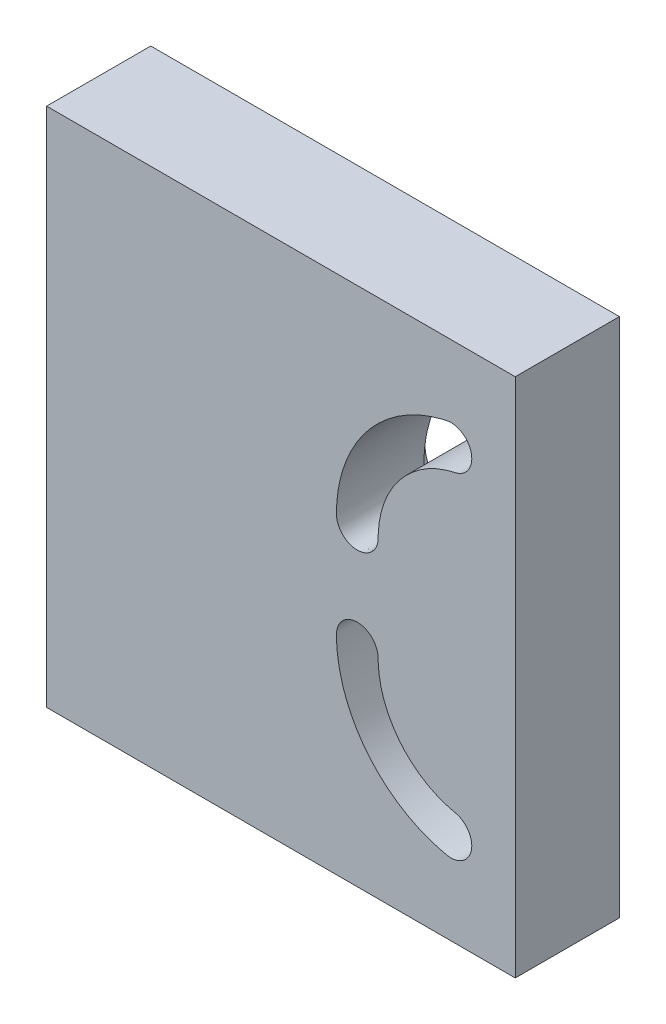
ISO-10303-21;
HEADER;
FILE_DESCRIPTION(('STEP AP214'),'2;1');
FILE_NAME('part.step','',(''),(''),'','','');
FILE_SCHEMA(('AUTOMOTIVE_DESIGN { 1 0 10303 214 1 1 1 1 }'));
ENDSEC;
DATA;
#1=APPLICATION_CONTEXT('core data for automotive mechanical design processes');
#2=APPLICATION_PROTOCOL_DEFINITION('international standard','automotive_design',2000,#1);
#3=PRODUCT_CONTEXT('',#1,'mechanical');
#4=PRODUCT('Part','Part','',(#3));
#5=PRODUCT_RELATED_PRODUCT_CATEGORY('part','',(#4));
#6=PRODUCT_DEFINITION_FORMATION('','',#4);
#7=PRODUCT_DEFINITION_CONTEXT('part definition',#1,'design');
#8=PRODUCT_DEFINITION('design','',#6,#7);
#9=PRODUCT_DEFINITION_SHAPE('','',#8);
#10=(LENGTH_UNIT() NAMED_UNIT(*) SI_UNIT(.MILLI.,.METRE.));
#11=(NAMED_UNIT(*) PLANE_ANGLE_UNIT() SI_UNIT($,.RADIAN.));
#12=(NAMED_UNIT(*) SI_UNIT($,.STERADIAN.) SOLID_ANGLE_UNIT());
#13=UNCERTAINTY_MEASURE_WITH_UNIT(LENGTH_MEASURE(1.E-05),#10,'distance_accuracy_value','');
#14=(GEOMETRIC_REPRESENTATION_CONTEXT(3) GLOBAL_UNCERTAINTY_ASSIGNED_CONTEXT((#13)) GLOBAL_UNIT_ASSIGNED_CONTEXT((#10,
#11,#12)) REPRESENTATION_CONTEXT('',''));
#15=CARTESIAN_POINT('',(0.,0.,0.));
#16=DIRECTION('',(0.,0.,1.));
#17=DIRECTION('',(1.,0.,0.));
#18=AXIS2_PLACEMENT_3D('',#15,#16,#17);
#19=CARTESIAN_POINT('',(0.,0.,20.));
#20=DIRECTION('',(0.,0.,1.));
#21=DIRECTION('',(1.,0.,0.));
#22=AXIS2_PLACEMENT_3D('',#19,#20,#21);
#23=PLANE('',#22);
#24=DIRECTION('',(0.,-1.,0.));
#25=VECTOR('',#24,1.);
#26=CARTESIAN_POINT('',(-45.,50.,20.));
#27=LINE('',#26,#25);
#28=CARTESIAN_POINT('',(-45.,50.,20.));
#29=VERTEX_POINT('',#28);
#30=CARTESIAN_POINT('',(-45.,-50.,20.));
#31=VERTEX_POINT('',#30);
#32=EDGE_CURVE('E66',#29,#31,#27,.T.);
#33=ORIENTED_EDGE('',*,*,#32,.T.);
#34=DIRECTION('',(1.,0.,0.));
#35=VECTOR('',#34,1.);
#36=CARTESIAN_POINT('',(-45.,-50.,20.));
#37=LINE('',#36,#35);
#38=CARTESIAN_POINT('',(45.,-50.,20.));
#39=VERTEX_POINT('',#38);
#40=EDGE_CURVE('E92',#31,#39,#37,.T.);
#41=ORIENTED_EDGE('',*,*,#40,.T.);
#42=DIRECTION('',(0.,-1.,0.));
#43=VECTOR('',#42,1.);
#44=CARTESIAN_POINT('',(45.,50.,20.));
#45=LINE('',#44,#43);
#46=CARTESIAN_POINT('',(45.,50.,20.));
#47=VERTEX_POINT('',#46);
#48=EDGE_CURVE('E168',#47,#39,#45,.T.);
#49=ORIENTED_EDGE('',*,*,#48,.F.);
#50=DIRECTION('',(1.,0.,0.));
#51=VECTOR('',#50,1.);
#52=CARTESIAN_POINT('',(-45.,50.,20.));
#53=LINE('',#52,#51);
#54=EDGE_CURVE('E171',#29,#47,#53,.T.);
#55=ORIENTED_EDGE('',*,*,#54,.F.);
#56=EDGE_LOOP('',(#33,#41,#49,#55));
#57=FACE_BOUND('',#56,.T.);
#58=CARTESIAN_POINT('',(33.4696036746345,28.2888015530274,20.));
#59=CARTESIAN_POINT('',(24.4679280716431,26.369253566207,20.));
#60=CARTESIAN_POINT('',(18.6756217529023,19.2163509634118,20.));
#61=CARTESIAN_POINT('',(18.6695740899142,10.012287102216,20.));
#62=CARTESIAN_POINT('',(18.669572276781,10.0095276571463,20.));
#63=CARTESIAN_POINT('',(18.6695698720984,10.0040087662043,20.));
#64=CARTESIAN_POINT('',(18.6695706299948,9.9957304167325,20.));
#65=CARTESIAN_POINT('',(18.6695590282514,9.99021153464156,20.));
#66=CARTESIAN_POINT('',(18.6695503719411,9.98745210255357,20.));
#67=CARTESIAN_POINT('',(18.6445971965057,2.03295525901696,20.));
#68=CARTESIAN_POINT('',(10.6900615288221,2.03519274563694,20.));
#69=CARTESIAN_POINT('',(10.66958330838,9.98970236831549,20.));
#70=CARTESIAN_POINT('',(10.6695774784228,9.99196694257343,20.));
#71=CARTESIAN_POINT('',(10.6695696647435,9.99649610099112,20.));
#72=CARTESIAN_POINT('',(10.6695699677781,10.0032898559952,20.));
#73=CARTESIAN_POINT('',(10.6695711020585,10.0078190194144,20.));
#74=CARTESIAN_POINT('',(10.6695719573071,10.0100836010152,20.));
#75=CARTESIAN_POINT('',(10.6745374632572,23.1580650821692,20.));
#76=CARTESIAN_POINT('',(18.9488309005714,33.3759665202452,20.));
#77=CARTESIAN_POINT('',(31.8084650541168,36.1144425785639,20.));
#78=CARTESIAN_POINT('',(31.8106799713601,36.114914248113,20.));
#79=CARTESIAN_POINT('',(31.8151099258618,36.1158570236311,20.));
#80=CARTESIAN_POINT('',(31.8217551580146,36.1172698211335,20.));
#81=CARTESIAN_POINT('',(31.8261869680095,36.1182038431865,20.));
#82=CARTESIAN_POINT('',(31.8284032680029,36.1186689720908,20.));
#83=CARTESIAN_POINT('',(39.6133454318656,37.7524737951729,20.));
#84=CARTESIAN_POINT('',(41.2693749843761,29.9722290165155,20.));
#85=CARTESIAN_POINT('',(33.493891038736,28.2939882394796,20.));
#86=CARTESIAN_POINT('',(33.4911937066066,28.2934060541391,20.));
#87=CARTESIAN_POINT('',(33.4857978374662,28.2922472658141,20.));
#88=CARTESIAN_POINT('',(33.4777002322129,28.290526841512,20.));
#89=CARTESIAN_POINT('',(33.4723024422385,28.2893770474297,20.));
#90=CARTESIAN_POINT('',(33.4696036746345,28.2888015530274,20.));
#91=(BOUNDED_CURVE() B_SPLINE_CURVE(3,(#58,#59,#60,#61,#62,#63,#64,#65,#66,#67,#68,#69,#70,#71,
#72,#73,#74,#75,#76,#77,#78,#79,#80,#81,#82,#83,#84,#85,#86,#87,#88,#89,#90),.UNSPECIFIED.,.T.,
.F.) B_SPLINE_CURVE_WITH_KNOTS((4,3,1,1,3,3,1,1,3,3,1,1,3,3,1,1,4),(0.,0.321286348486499,
0.32139944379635,0.321512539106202,0.321625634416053,0.43091797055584,0.431010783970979,
0.431103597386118,0.431196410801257,0.890089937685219,0.890182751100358,0.890275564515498,
0.890368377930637,0.999660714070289,0.999773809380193,0.999886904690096,1.),
.UNSPECIFIED.) CURVE() GEOMETRIC_REPRESENTATION_ITEM() RATIONAL_B_SPLINE_CURVE((1.,
0.851706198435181,0.851706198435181,1.,1.,1.,1.,1.,1.,0.335237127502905,0.335237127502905,1.,1.,
1.,1.,1.,1.,0.851589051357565,0.851589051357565,1.,1.,1.,1.,1.,1.,0.335237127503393,
0.335237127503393,1.,1.,1.,1.,1.,1.)) REPRESENTATION_ITEM(''));
#92=CARTESIAN_POINT('',(33.4696036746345,28.2888015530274,20.));
#93=VERTEX_POINT('',#92);
#94=EDGE_CURVE('E85',#93,#93,#91,.T.);
#95=ORIENTED_EDGE('',*,*,#94,.T.);
#96=EDGE_LOOP('',(#95));
#97=FACE_BOUND('',#96,.T.);
#98=CARTESIAN_POINT('',(33.4696036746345,-28.2888015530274,20.));
#99=CARTESIAN_POINT('',(24.4679280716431,-26.369253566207,20.));
#100=CARTESIAN_POINT('',(18.6756217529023,-19.2163509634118,20.));
#101=CARTESIAN_POINT('',(18.6695740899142,-10.012287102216,20.));
#102=CARTESIAN_POINT('',(18.669572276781,-10.0095276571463,20.));
#103=CARTESIAN_POINT('',(18.6695698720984,-10.0040087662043,20.));
#104=CARTESIAN_POINT('',(18.6695706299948,-9.9957304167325,20.));
#105=CARTESIAN_POINT('',(18.6695590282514,-9.99021153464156,20.));
#106=CARTESIAN_POINT('',(18.6695503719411,-9.98745210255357,20.));
#107=CARTESIAN_POINT('',(18.6445971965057,-2.03295525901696,20.));
#108=CARTESIAN_POINT('',(10.6900615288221,-2.03519274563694,20.));
#109=CARTESIAN_POINT('',(10.66958330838,-9.98970236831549,20.));
#110=CARTESIAN_POINT('',(10.6695774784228,-9.99196694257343,20.));
#111=CARTESIAN_POINT('',(10.6695696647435,-9.99649610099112,20.));
#112=CARTESIAN_POINT('',(10.6695699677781,-10.0032898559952,20.));
#113=CARTESIAN_POINT('',(10.6695711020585,-10.0078190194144,20.));
#114=CARTESIAN_POINT('',(10.6695719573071,-10.0100836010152,20.));
#115=CARTESIAN_POINT('',(10.6745374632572,-23.1580650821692,20.));
#116=CARTESIAN_POINT('',(18.9488309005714,-33.3759665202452,20.));
#117=CARTESIAN_POINT('',(31.8084650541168,-36.1144425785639,20.));
#118=CARTESIAN_POINT('',(31.8106799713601,-36.114914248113,20.));
#119=CARTESIAN_POINT('',(31.8151099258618,-36.1158570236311,20.));
#120=CARTESIAN_POINT('',(31.8217551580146,-36.1172698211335,20.));
#121=CARTESIAN_POINT('',(31.8261869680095,-36.1182038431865,20.));
#122=CARTESIAN_POINT('',(31.8284032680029,-36.1186689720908,20.));
#123=CARTESIAN_POINT('',(39.6133454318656,-37.7524737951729,20.));
#124=CARTESIAN_POINT('',(41.2693749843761,-29.9722290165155,20.));
#125=CARTESIAN_POINT('',(33.493891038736,-28.2939882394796,20.));
#126=CARTESIAN_POINT('',(33.4911937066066,-28.2934060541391,20.));
#127=CARTESIAN_POINT('',(33.4857978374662,-28.2922472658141,20.));
#128=CARTESIAN_POINT('',(33.4777002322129,-28.290526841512,20.));
#129=CARTESIAN_POINT('',(33.4723024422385,-28.2893770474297,20.));
#130=CARTESIAN_POINT('',(33.4696036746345,-28.2888015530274,20.));
#131=(BOUNDED_CURVE() B_SPLINE_CURVE(3,(#98,#99,#100,#101,#102,#103,#104,#105,#106,#107,#108,
#109,#110,#111,#112,#113,#114,#115,#116,#117,#118,#119,#120,#121,#122,#123,#124,#125,#126,#127,
#128,#129,#130),.UNSPECIFIED.,.T.,.F.) B_SPLINE_CURVE_WITH_KNOTS((4,3,1,1,3,3,1,1,3,3,1,1,3,3,1,
1,4),(0.,0.321286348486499,0.32139944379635,0.321512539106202,0.321625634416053,
0.43091797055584,0.431010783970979,0.431103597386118,0.431196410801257,0.890089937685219,
0.890182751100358,0.890275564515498,0.890368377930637,0.999660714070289,0.999773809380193,
0.999886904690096,1.),
.UNSPECIFIED.) CURVE() GEOMETRIC_REPRESENTATION_ITEM() RATIONAL_B_SPLINE_CURVE((1.,
0.851706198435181,0.851706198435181,1.,1.,1.,1.,1.,1.,0.335237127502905,0.335237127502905,1.,1.,
1.,1.,1.,1.,0.851589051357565,0.851589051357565,1.,1.,1.,1.,1.,1.,0.335237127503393,
0.335237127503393,1.,1.,1.,1.,1.,1.)) REPRESENTATION_ITEM(''));
#132=CARTESIAN_POINT('',(33.4696036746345,-28.2888015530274,20.));
#133=VERTEX_POINT('',#132);
#134=EDGE_CURVE('E98',#133,#133,#131,.T.);
#135=ORIENTED_EDGE('',*,*,#134,.F.);
#136=EDGE_LOOP('',(#135));
#137=FACE_BOUND('',#136,.T.);
#138=ADVANCED_FACE('F32',(#57,#97,#137),#23,.T.);
#139=CARTESIAN_POINT('',(0.,0.,0.));
#140=DIRECTION('',(0.,0.,1.));
#141=DIRECTION('',(1.,0.,0.));
#142=AXIS2_PLACEMENT_3D('',#139,#140,#141);
#143=PLANE('',#142);
#144=CARTESIAN_POINT('',(7.6695721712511,10.0112165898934,0.));
#145=CARTESIAN_POINT('',(7.66971532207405,10.5596922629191,0.));
#146=CARTESIAN_POINT('',(7.68499199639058,11.108175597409,0.));
#147=CARTESIAN_POINT('',(7.74571047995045,12.2000099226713,0.));
#148=CARTESIAN_POINT('',(7.79096211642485,12.743371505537,0.));
#149=CARTESIAN_POINT('',(7.91133528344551,13.8250069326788,0.));
#150=CARTESIAN_POINT('',(7.98636017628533,14.3632915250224,0.));
#151=CARTESIAN_POINT('',(8.1658290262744,15.4348297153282,0.));
#152=CARTESIAN_POINT('',(8.27026783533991,15.96808417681,0.));
#153=CARTESIAN_POINT('',(8.5083708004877,17.0296178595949,0.));
#154=CARTESIAN_POINT('',(8.64211692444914,17.5578787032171,0.));
#155=CARTESIAN_POINT('',(8.93943281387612,18.6093270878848,0.));
#156=CARTESIAN_POINT('',(9.10317472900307,19.1324659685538,0.));
#157=CARTESIAN_POINT('',(9.45953070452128,20.1695594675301,0.));
#158=CARTESIAN_POINT('',(9.65218124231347,20.6835015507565,0.));
#159=CARTESIAN_POINT('',(10.0645530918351,21.6971125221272,0.));
#160=CARTESIAN_POINT('',(10.284119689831,22.1968443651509,0.));
#161=CARTESIAN_POINT('',(10.7493520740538,23.1815158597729,0.));
#162=CARTESIAN_POINT('',(10.9949078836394,23.6665074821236,0.));
#163=CARTESIAN_POINT('',(11.5121277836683,24.6220173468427,0.));
#164=CARTESIAN_POINT('',(11.7837771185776,25.0925435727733,0.));
#165=CARTESIAN_POINT('',(12.3533666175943,26.0190148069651,0.));
#166=CARTESIAN_POINT('',(12.6513703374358,26.474920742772,0.));
#167=CARTESIAN_POINT('',(13.2737244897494,27.3721325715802,0.));
#168=CARTESIAN_POINT('',(13.5982121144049,27.813343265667,0.));
#169=CARTESIAN_POINT('',(14.2720419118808,28.6786764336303,0.));
#170=CARTESIAN_POINT('',(14.6214616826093,29.1027384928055,0.));
#171=CARTESIAN_POINT('',(15.3409846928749,29.9281172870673,0.));
#172=CARTESIAN_POINT('',(15.7109394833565,30.3295634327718,0.));
#173=CARTESIAN_POINT('',(16.470869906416,31.1099539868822,0.));
#174=CARTESIAN_POINT('',(16.8607607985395,31.4889809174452,0.));
#175=CARTESIAN_POINT('',(17.6604265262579,32.2246816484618,0.));
#176=CARTESIAN_POINT('',(18.0701827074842,32.5813757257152,0.));
#177=CARTESIAN_POINT('',(18.9094730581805,33.2725373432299,0.));
#178=CARTESIAN_POINT('',(19.3390468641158,33.6069567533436,0.));
#179=CARTESIAN_POINT('',(20.2182212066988,34.2533022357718,0.));
#180=CARTESIAN_POINT('',(20.6679137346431,34.5651031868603,0.));
#181=CARTESIAN_POINT('',(21.5858702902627,35.1647836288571,0.));
#182=CARTESIAN_POINT('',(22.0542088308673,35.4525490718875,0.));
#183=CARTESIAN_POINT('',(23.0032242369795,35.9999172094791,0.));
#184=CARTESIAN_POINT('',(23.4838075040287,36.2596822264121,0.));
#185=CARTESIAN_POINT('',(24.4563904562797,36.75141736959,0.));
#186=CARTESIAN_POINT('',(24.9483320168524,36.9835024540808,0.));
#187=CARTESIAN_POINT('',(25.9435719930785,37.4200109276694,0.));
#188=CARTESIAN_POINT('',(26.4468548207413,37.62446986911,0.));
#189=CARTESIAN_POINT('',(27.4648551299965,38.0056326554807,0.));
#190=CARTESIAN_POINT('',(27.9795909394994,38.1822877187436,0.));
#191=CARTESIAN_POINT('',(28.7591767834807,38.4260360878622,0.));
#192=CARTESIAN_POINT('',(29.0207223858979,38.503856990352,0.));
#193=CARTESIAN_POINT('',(29.5466740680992,38.6525926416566,0.));
#194=CARTESIAN_POINT('',(29.8110865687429,38.7234848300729,0.));
#195=CARTESIAN_POINT('',(30.3428391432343,38.8580355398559,0.));
#196=CARTESIAN_POINT('',(30.6101866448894,38.9216644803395,0.));
#197=CARTESIAN_POINT('',(31.0124521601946,39.0121139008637,0.));
#198=CARTESIAN_POINT('',(31.1467963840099,39.041440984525,0.));
#199=CARTESIAN_POINT('',(31.3489083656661,39.0813923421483,0.));
#200=CARTESIAN_POINT('',(31.416269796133,39.0940192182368,0.));
#201=CARTESIAN_POINT('',(31.5511669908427,39.1172344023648,0.));
#202=CARTESIAN_POINT('',(31.6187018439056,39.1278279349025,0.));
#203=CARTESIAN_POINT('',(31.75395123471,39.1467787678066,0.));
#204=CARTESIAN_POINT('',(31.8216651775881,39.1551403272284,0.));
#205=CARTESIAN_POINT('',(31.9572366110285,39.1699518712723,0.));
#206=CARTESIAN_POINT('',(32.0250939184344,39.1764035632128,0.));
#207=CARTESIAN_POINT('',(32.2289544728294,39.1927587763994,0.));
#208=CARTESIAN_POINT('',(32.3652126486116,39.1996577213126,0.));
#209=CARTESIAN_POINT('',(32.63834898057,39.2054439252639,0.));
#210=CARTESIAN_POINT('',(32.7752276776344,39.2043040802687,0.));
#211=CARTESIAN_POINT('',(33.0496239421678,39.1939448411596,0.));
#212=CARTESIAN_POINT('',(33.1871394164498,39.1846698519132,0.));
#213=CARTESIAN_POINT('',(33.4613828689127,39.158128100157,0.));
#214=CARTESIAN_POINT('',(33.5981109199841,39.1408620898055,0.));
#215=CARTESIAN_POINT('',(33.8693512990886,39.0984237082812,0.));
#216=CARTESIAN_POINT('',(34.0038724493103,39.0733078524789,0.));
#217=CARTESIAN_POINT('',(34.2707141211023,39.015270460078,0.));
#218=CARTESIAN_POINT('',(34.4030407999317,38.9823772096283,0.));
#219=CARTESIAN_POINT('',(34.6655342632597,38.9089473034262,0.));
#220=CARTESIAN_POINT('',(34.7957013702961,38.8684118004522,0.));
#221=CARTESIAN_POINT('',(35.0540438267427,38.779555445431,0.));
#222=CARTESIAN_POINT('',(35.1822067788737,38.7311985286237,0.));
#223=CARTESIAN_POINT('',(35.436059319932,38.6268086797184,0.));
#224=CARTESIAN_POINT('',(35.5617346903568,38.5707412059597,0.));
#225=CARTESIAN_POINT('',(35.8096821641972,38.4513996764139,0.));
#226=CARTESIAN_POINT('',(35.9319527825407,38.3881225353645,0.));
#227=CARTESIAN_POINT('',(36.1721055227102,38.2547222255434,0.));
#228=CARTESIAN_POINT('',(36.2900023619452,38.1846255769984,0.));
#229=CARTESIAN_POINT('',(36.5210046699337,38.037843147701,0.));
#230=CARTESIAN_POINT('',(36.6341263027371,37.9611827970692,0.));
#231=CARTESIAN_POINT('',(36.8557608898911,37.8013532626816,0.));
#232=CARTESIAN_POINT('',(36.9642714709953,37.7181807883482,0.));
#233=CARTESIAN_POINT('',(37.1765030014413,37.5453577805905,0.));
#234=CARTESIAN_POINT('',(37.2802099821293,37.4556900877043,0.));
#235=CARTESIAN_POINT('',(37.4826775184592,37.2699465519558,0.));
#236=CARTESIAN_POINT('',(37.5814105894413,37.1738407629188,0.));
#237=CARTESIAN_POINT('',(37.7730149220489,36.9761088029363,0.));
#238=CARTESIAN_POINT('',(37.8658909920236,36.8744872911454,0.));
#239=CARTESIAN_POINT('',(38.0449546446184,36.6665507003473,0.));
#240=CARTESIAN_POINT('',(38.1311783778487,36.5602667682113,0.));
#241=CARTESIAN_POINT('',(38.2969915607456,36.343051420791,0.));
#242=CARTESIAN_POINT('',(38.3765965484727,36.2321318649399,0.));
#243=CARTESIAN_POINT('',(38.5292664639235,36.005713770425,0.));
#244=CARTESIAN_POINT('',(38.602324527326,35.8902106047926,0.));
#245=CARTESIAN_POINT('',(38.7419767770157,35.6544672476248,0.));
#246=CARTESIAN_POINT('',(38.8085316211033,35.5342037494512,0.));
#247=CARTESIAN_POINT('',(38.9347065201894,35.2895275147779,0.));
#248=CARTESIAN_POINT('',(38.9942999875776,35.1651010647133,0.));
#249=CARTESIAN_POINT('',(39.1057984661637,34.9134421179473,0.));
#250=CARTESIAN_POINT('',(39.1577331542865,34.786222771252,0.));
#251=CARTESIAN_POINT('',(39.2537778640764,34.5295857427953,0.));
#252=CARTESIAN_POINT('',(39.2979255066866,34.400182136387,0.));
#253=CARTESIAN_POINT('',(39.3785234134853,34.1392149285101,0.));
#254=CARTESIAN_POINT('',(39.4149852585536,34.0076549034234,0.));
#255=CARTESIAN_POINT('',(39.480212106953,33.7423728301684,0.));
#256=CARTESIAN_POINT('',(39.5089622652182,33.6086471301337,0.));
#257=CARTESIAN_POINT('',(39.5587162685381,33.3388663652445,0.));
#258=CARTESIAN_POINT('',(39.5796686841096,33.2028018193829,0.));
#259=CARTESIAN_POINT('',(39.6135993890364,32.9294020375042,0.));
#260=CARTESIAN_POINT('',(39.6265614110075,32.7920647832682,0.));
#261=CARTESIAN_POINT('',(39.6443143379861,32.5176188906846,0.));
#262=CARTESIAN_POINT('',(39.6491496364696,32.3805131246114,0.));
#263=CARTESIAN_POINT('',(39.6507613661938,32.106813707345,0.));
#264=CARTESIAN_POINT('',(39.6475706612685,31.9702202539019,0.));
#265=CARTESIAN_POINT('',(39.6331334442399,31.6975474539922,0.));
#266=CARTESIAN_POINT('',(39.6218920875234,31.5614678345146,0.));
#267=CARTESIAN_POINT('',(39.5914381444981,31.2898167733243,0.));
#268=CARTESIAN_POINT('',(39.5722032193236,31.1542478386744,0.));
#269=CARTESIAN_POINT('',(39.5256725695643,30.8835854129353,0.));
#270=CARTESIAN_POINT('',(39.4983248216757,30.7485008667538,0.));
#271=CARTESIAN_POINT('',(39.4357491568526,30.4801168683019,0.));
#272=CARTESIAN_POINT('',(39.4005183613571,30.3468180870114,0.));
#273=CARTESIAN_POINT('',(39.322467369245,30.0833824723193,0.));
#274=CARTESIAN_POINT('',(39.2796968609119,29.9532309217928,0.));
#275=CARTESIAN_POINT('',(39.1867386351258,29.6960739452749,0.));
#276=CARTESIAN_POINT('',(39.1365749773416,29.5690598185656,0.));
#277=CARTESIAN_POINT('',(39.0289063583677,29.3181450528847,0.));
#278=CARTESIAN_POINT('',(38.9713995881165,29.1942451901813,0.));
#279=CARTESIAN_POINT('',(38.8490065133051,28.9495714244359,0.));
#280=CARTESIAN_POINT('',(38.7840937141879,28.8288107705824,0.));
#281=CARTESIAN_POINT('',(38.6468561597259,28.5906123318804,0.));
#282=CARTESIAN_POINT('',(38.574489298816,28.4731988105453,0.));
#283=CARTESIAN_POINT('',(38.423090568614,28.2429687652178,0.));
#284=CARTESIAN_POINT('',(38.3440674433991,28.1301464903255,0.));
#285=CARTESIAN_POINT('',(38.1800502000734,27.9100761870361,0.));
#286=CARTESIAN_POINT('',(38.0950985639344,27.8027964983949,0.));
#287=CARTESIAN_POINT('',(37.9192636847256,27.5936350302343,0.));
#288=CARTESIAN_POINT('',(37.8283945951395,27.4917413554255,0.));
#289=CARTESIAN_POINT('',(37.6406958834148,27.29338015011,0.));
#290=CARTESIAN_POINT('',(37.5438595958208,27.1969189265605,0.));
#291=CARTESIAN_POINT('',(37.344252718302,27.0093950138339,0.));
#292=CARTESIAN_POINT('',(37.2414568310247,26.9183592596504,0.));
#293=CARTESIAN_POINT('',(37.0302031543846,26.7420581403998,0.));
#294=CARTESIAN_POINT('',(36.9217208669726,26.6568221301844,0.));
#295=CARTESIAN_POINT('',(36.700260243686,26.4931174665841,0.));
#296=CARTESIAN_POINT('',(36.5872961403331,26.4146295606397,0.));
#297=CARTESIAN_POINT('',(36.3576337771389,26.2649182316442,0.));
#298=CARTESIAN_POINT('',(36.2409625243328,26.1936533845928,0.));
#299=CARTESIAN_POINT('',(36.0038123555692,26.0581802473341,0.));
#300=CARTESIAN_POINT('',(35.8833390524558,25.9939621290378,0.));
#301=CARTESIAN_POINT('',(35.6385405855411,25.8725042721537,0.));
#302=CARTESIAN_POINT('',(35.5142063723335,25.8152827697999,0.));
#303=CARTESIAN_POINT('',(35.2617510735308,25.7079472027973,0.));
#304=CARTESIAN_POINT('',(35.1336137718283,25.6578712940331,0.));
#305=CARTESIAN_POINT('',(34.8737364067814,25.5650766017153,0.));
#306=CARTESIAN_POINT('',(34.7419781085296,25.5224087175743,0.));
#307=CARTESIAN_POINT('',(34.5422496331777,25.4641762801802,0.));
#308=CARTESIAN_POINT('',(34.4751206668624,25.4456803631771,0.));
#309=CARTESIAN_POINT('',(34.3400176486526,25.4106903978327,0.));
#310=CARTESIAN_POINT('',(34.2720411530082,25.3942057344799,0.));
#311=CARTESIAN_POINT('',(34.135451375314,25.3629377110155,0.));
#312=CARTESIAN_POINT('',(34.0668366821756,25.3481606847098,0.));
#313=CARTESIAN_POINT('',(33.929733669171,25.318203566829,0.));
#314=CARTESIAN_POINT('',(33.8612453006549,25.3030237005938,0.));
#315=CARTESIAN_POINT('',(33.7247715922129,25.2713578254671,0.));
#316=CARTESIAN_POINT('',(33.6567853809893,25.25487559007,0.));
#317=CARTESIAN_POINT('',(33.5211570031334,25.2211527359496,0.));
#318=CARTESIAN_POINT('',(33.4535144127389,25.2039137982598,0.));
#319=CARTESIAN_POINT('',(33.2513270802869,25.1509149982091,0.));
#320=CARTESIAN_POINT('',(33.1171381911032,25.1137834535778,0.));
#321=CARTESIAN_POINT('',(32.8502120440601,25.0361060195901,0.));
#322=CARTESIAN_POINT('',(32.7174715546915,24.9955711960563,0.));
#323=CARTESIAN_POINT('',(32.4534296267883,24.9110970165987,0.));
#324=CARTESIAN_POINT('',(32.3221254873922,24.8671661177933,0.));
#325=CARTESIAN_POINT('',(32.0609513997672,24.7759282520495,0.));
#326=CARTESIAN_POINT('',(31.9310793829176,24.7286271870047,0.));
#327=CARTESIAN_POINT('',(31.5437168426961,24.5817018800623,0.));
#328=CARTESIAN_POINT('',(31.2881496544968,24.4769499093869,0.));
#329=CARTESIAN_POINT('',(30.7826284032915,24.25408912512,0.));
#330=CARTESIAN_POINT('',(30.5326800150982,24.1359674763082,0.));
#331=CARTESIAN_POINT('',(30.038451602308,23.8862202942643,0.));
#332=CARTESIAN_POINT('',(29.7941960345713,23.7545463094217,0.));
#333=CARTESIAN_POINT('',(29.3115561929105,23.4775129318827,0.));
#334=CARTESIAN_POINT('',(29.0732177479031,23.3320737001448,0.));
#335=CARTESIAN_POINT('',(28.6025982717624,23.0273427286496,0.));
#336=CARTESIAN_POINT('',(28.3703886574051,22.8679407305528,0.));
#337=CARTESIAN_POINT('',(27.9145061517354,22.5367995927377,0.));
#338=CARTESIAN_POINT('',(27.6908440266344,22.3650456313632,0.));
#339=CARTESIAN_POINT('',(27.2544301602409,22.0107943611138,0.));
#340=CARTESIAN_POINT('',(27.0416206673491,21.8283682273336,0.));
#341=CARTESIAN_POINT('',(26.6267950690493,21.4529044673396,0.));
#342=CARTESIAN_POINT('',(26.4247471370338,21.2599020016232,0.));
#343=CARTESIAN_POINT('',(26.0312986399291,20.8634386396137,0.));
#344=CARTESIAN_POINT('',(25.8398952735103,20.659980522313,0.));
#345=CARTESIAN_POINT('',(25.467658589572,20.2426691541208,0.));
#346=CARTESIAN_POINT('',(25.2868538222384,20.0287904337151,0.));
#347=CARTESIAN_POINT('',(24.9360087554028,19.5904422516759,0.));
#348=CARTESIAN_POINT('',(24.7660331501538,19.365920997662,0.));
#349=CARTESIAN_POINT('',(24.4380128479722,18.9075288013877,0.));
#350=CARTESIAN_POINT('',(24.2799971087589,18.6736371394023,0.));
#351=CARTESIAN_POINT('',(23.9774973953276,18.1987966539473,0.));
#352=CARTESIAN_POINT('',(23.8329536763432,17.9578858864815,0.));
#353=CARTESIAN_POINT('',(23.5576112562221,17.4698627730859,0.));
#354=CARTESIAN_POINT('',(23.4267497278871,17.2227858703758,0.));
#355=CARTESIAN_POINT('',(23.1785416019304,16.7222772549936,0.));
#356=CARTESIAN_POINT('',(23.0611800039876,16.4688529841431,0.));
#357=CARTESIAN_POINT('',(22.8400495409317,15.9556167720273,0.));
#358=CARTESIAN_POINT('',(22.7363047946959,15.6957944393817,0.));
#359=CARTESIAN_POINT('',(22.5423875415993,15.1697643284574,0.));
#360=CARTESIAN_POINT('',(22.4522802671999,14.9035325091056,0.));
#361=CARTESIAN_POINT('',(22.2860706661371,14.3653746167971,0.));
#362=CARTESIAN_POINT('',(22.2100355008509,14.0934278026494,0.));
#363=CARTESIAN_POINT('',(22.072815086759,13.5463945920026,0.));
#364=CARTESIAN_POINT('',(22.0116001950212,13.2713156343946,0.));
#365=CARTESIAN_POINT('',(21.9043480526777,12.7195807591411,0.));
#366=CARTESIAN_POINT('',(21.8582397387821,12.4429386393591,0.));
#367=CARTESIAN_POINT('',(21.7809523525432,11.8877963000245,0.));
#368=CARTESIAN_POINT('',(21.7497609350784,11.6092978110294,0.));
#369=CARTESIAN_POINT('',(21.7141381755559,11.1904666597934,0.));
#370=CARTESIAN_POINT('',(21.7041218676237,11.0505873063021,0.));
#371=CARTESIAN_POINT('',(21.6878608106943,10.770360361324,0.));
#372=CARTESIAN_POINT('',(21.6816226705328,10.6300123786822,0.));
#373=CARTESIAN_POINT('',(21.674994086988,10.4192836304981,0.));
#374=CARTESIAN_POINT('',(21.6732389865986,10.3489435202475,0.));
#375=CARTESIAN_POINT('',(21.6708432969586,10.2081455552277,0.));
#376=CARTESIAN_POINT('',(21.6702042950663,10.137687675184,0.));
#377=CARTESIAN_POINT('',(21.6692236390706,9.99676210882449,0.));
#378=CARTESIAN_POINT('',(21.6688820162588,9.92629442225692,0.));
#379=CARTESIAN_POINT('',(21.6662867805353,9.78554810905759,0.));
#380=CARTESIAN_POINT('',(21.664037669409,9.71526942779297,0.));
#381=CARTESIAN_POINT('',(21.6570988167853,9.57496119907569,0.));
#382=CARTESIAN_POINT('',(21.652413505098,9.50493143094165,0.));
#383=CARTESIAN_POINT('',(21.6410328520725,9.36513141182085,0.));
#384=CARTESIAN_POINT('',(21.6343401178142,9.29536094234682,0.));
#385=CARTESIAN_POINT('',(21.6111655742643,9.08691488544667,0.));
#386=CARTESIAN_POINT('',(21.5915604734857,8.94857175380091,0.));
#387=CARTESIAN_POINT('',(21.5442773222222,8.67421705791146,0.));
#388=CARTESIAN_POINT('',(21.5166530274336,8.53819615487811,0.));
#389=CARTESIAN_POINT('',(21.4534807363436,8.26858542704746,0.));
#390=CARTESIAN_POINT('',(21.4179652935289,8.1349879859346,0.));
#391=CARTESIAN_POINT('',(21.3391272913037,7.8701951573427,0.));
#392=CARTESIAN_POINT('',(21.2958088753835,7.73899853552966,0.));
#393=CARTESIAN_POINT('',(21.2013392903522,7.47901034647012,0.));
#394=CARTESIAN_POINT('',(21.1501650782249,7.35022714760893,0.));
#395=CARTESIAN_POINT('',(21.0398782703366,7.09510960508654,0.));
#396=CARTESIAN_POINT('',(20.9807160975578,6.96879669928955,0.));
#397=CARTESIAN_POINT('',(20.8550107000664,6.71991078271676,0.));
#398=CARTESIAN_POINT('',(20.7884680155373,6.59733749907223,0.));
#399=CARTESIAN_POINT('',(20.6486435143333,6.35716160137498,0.));
#400=CARTESIAN_POINT('',(20.5754082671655,6.23953187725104,0.));
#401=CARTESIAN_POINT('',(20.4223176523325,6.00915518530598,0.));
#402=CARTESIAN_POINT('',(20.3424822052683,5.89639498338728,0.));
#403=CARTESIAN_POINT('',(20.1761683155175,5.67577623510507,0.));
#404=CARTESIAN_POINT('',(20.0896858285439,5.56792073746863,0.));
#405=CARTESIAN_POINT('',(19.9101210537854,5.35707669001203,0.));
#406=CARTESIAN_POINT('',(19.8170128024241,5.25411025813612,0.));
#407=CARTESIAN_POINT('',(19.6243276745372,5.05333878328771,0.));
#408=CARTESIAN_POINT('',(19.5247183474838,4.95556488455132,0.));
#409=CARTESIAN_POINT('',(19.3200892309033,4.76631367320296,0.));
#410=CARTESIAN_POINT('',(19.2150816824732,4.67482312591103,0.));
#411=CARTESIAN_POINT('',(19.0004727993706,4.49885403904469,0.));
#412=CARTESIAN_POINT('',(18.8909053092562,4.41433422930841,0.));
#413=CARTESIAN_POINT('',(18.6671486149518,4.25208459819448,0.));
#414=CARTESIAN_POINT('',(18.5529678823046,4.17434309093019,0.));
#415=CARTESIAN_POINT('',(18.3200132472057,4.02560438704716,0.));
#416=CARTESIAN_POINT('',(18.2012316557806,3.95461923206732,0.));
#417=CARTESIAN_POINT('',(17.9590227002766,3.81946412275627,0.));
#418=CARTESIAN_POINT('',(17.8355739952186,3.75533240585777,0.));
#419=CARTESIAN_POINT('',(17.584654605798,3.63433999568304,0.));
#420=CARTESIAN_POINT('',(17.4571718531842,3.57750433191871,0.));
#421=CARTESIAN_POINT('',(17.1995977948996,3.47176340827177,0.));
#422=CARTESIAN_POINT('',(17.0695200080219,3.42282520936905,0.));
#423=CARTESIAN_POINT('',(16.8073855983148,3.33298053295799,0.));
#424=CARTESIAN_POINT('',(16.6753430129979,3.29203309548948,0.));
#425=CARTESIAN_POINT('',(16.4091483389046,3.21804898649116,0.));
#426=CARTESIAN_POINT('',(16.2749976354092,3.18500733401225,0.));
#427=CARTESIAN_POINT('',(16.0045690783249,3.12690289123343,0.));
#428=CARTESIAN_POINT('',(15.8682861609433,3.10186365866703,0.));
#429=CARTESIAN_POINT('',(15.5935836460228,3.05979763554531,0.));
#430=CARTESIAN_POINT('',(15.4551559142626,3.04282406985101,0.));
#431=CARTESIAN_POINT('',(15.1775307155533,3.01706339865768,0.));
#432=CARTESIAN_POINT('',(15.038333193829,3.00827688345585,0.));
#433=CARTESIAN_POINT('',(14.7605499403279,2.99908151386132,0.));
#434=CARTESIAN_POINT('',(14.6219659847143,2.99861947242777,0.));
#435=CARTESIAN_POINT('',(14.3454260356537,3.00597672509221,0.));
#436=CARTESIAN_POINT('',(14.2074693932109,3.01377170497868,0.));
#437=CARTESIAN_POINT('',(13.9321917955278,3.03751599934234,0.));
#438=CARTESIAN_POINT('',(13.79487119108,3.05346937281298,0.));
#439=CARTESIAN_POINT('',(13.5207123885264,3.09354479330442,0.));
#440=CARTESIAN_POINT('',(13.3838802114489,3.11770803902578,0.));
#441=CARTESIAN_POINT('',(13.1112813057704,3.17424431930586,0.));
#442=CARTESIAN_POINT('',(12.9755221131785,3.20665370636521,0.));
#443=CARTESIAN_POINT('',(12.706602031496,3.27941889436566,0.));
#444=CARTESIAN_POINT('',(12.5734343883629,3.3197497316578,0.));
#445=CARTESIAN_POINT('',(12.3104540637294,3.40804730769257,0.));
#446=CARTESIAN_POINT('',(12.1806271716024,3.45597173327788,0.));
#447=CARTESIAN_POINT('',(11.9242711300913,3.55931753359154,0.));
#448=CARTESIAN_POINT('',(11.7977363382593,3.61472491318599,0.));
#449=CARTESIAN_POINT('',(11.5479604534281,3.73303246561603,0.));
#450=CARTESIAN_POINT('',(11.4247251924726,3.79594495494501,0.));
#451=CARTESIAN_POINT('',(11.181434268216,3.92940759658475,0.));
#452=CARTESIAN_POINT('',(11.0614040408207,4.00000410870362,0.));
#453=CARTESIAN_POINT('',(10.8254621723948,4.14836402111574,0.));
#454=CARTESIAN_POINT('',(10.709560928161,4.22614395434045,0.));
#455=CARTESIAN_POINT('',(10.4832031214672,4.38805112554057,0.));
#456=CARTESIAN_POINT('',(10.3727210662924,4.47214272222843,0.));
#457=CARTESIAN_POINT('',(10.1574042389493,4.64637077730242,0.));
#458=CARTESIAN_POINT('',(10.0525474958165,4.73648007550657,0.));
#459=CARTESIAN_POINT('',(9.84847941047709,4.92273790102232,0.));
#460=CARTESIAN_POINT('',(9.74926410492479,5.01888208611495,0.));
#461=CARTESIAN_POINT('',(9.5564171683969,5.21714435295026,0.));
#462=CARTESIAN_POINT('',(9.46280210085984,5.31927854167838,0.));
#463=CARTESIAN_POINT('',(9.28119519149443,5.52960435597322,0.));
#464=CARTESIAN_POINT('',(9.19324434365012,5.63783137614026,0.));
#465=CARTESIAN_POINT('',(9.02389196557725,5.8593378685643,0.));
#466=CARTESIAN_POINT('',(8.94249210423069,5.97261861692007,0.));
#467=CARTESIAN_POINT('',(8.78713198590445,6.20311447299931,0.));
#468=CARTESIAN_POINT('',(8.71312726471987,6.3202996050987,0.));
#469=CARTESIAN_POINT('',(8.57242491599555,6.55848929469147,0.));
#470=CARTESIAN_POINT('',(8.50570547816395,6.67948097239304,0.));
#471=CARTESIAN_POINT('',(8.3795001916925,6.92524600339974,0.));
#472=CARTESIAN_POINT('',(8.32001747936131,7.05002096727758,0.));
#473=CARTESIAN_POINT('',(8.20832573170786,7.30337783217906,0.));
#474=CARTESIAN_POINT('',(8.15614649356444,7.43197287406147,0.));
#475=CARTESIAN_POINT('',(8.05927073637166,7.69279419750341,0.));
#476=CARTESIAN_POINT('',(8.01461908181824,7.82503713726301,0.));
#477=CARTESIAN_POINT('',(7.93329737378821,8.09175102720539,0.));
#478=CARTESIAN_POINT('',(7.89661616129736,8.22621857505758,0.));
#479=CARTESIAN_POINT('',(7.83156220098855,8.49632529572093,0.));
#480=CARTESIAN_POINT('',(7.80314254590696,8.63195316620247,0.));
#481=CARTESIAN_POINT('',(7.75443490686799,8.90448437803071,0.));
#482=CARTESIAN_POINT('',(7.7341367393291,9.04138590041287,0.));
#483=CARTESIAN_POINT('',(7.70164628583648,9.31646252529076,0.));
#484=CARTESIAN_POINT('',(7.68947249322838,9.45463981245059,0.));
#485=CARTESIAN_POINT('',(7.67329799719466,9.73228359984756,0.));
#486=CARTESIAN_POINT('',(7.66934555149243,9.87175291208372,0.));
#487=CARTESIAN_POINT('',(7.6695721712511,10.0112165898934,0.));
#488=B_SPLINE_CURVE_WITH_KNOTS('',3,(#144,#145,#146,#147,#148,#149,#150,#151,#152,#153,#154,
#155,#156,#157,#158,#159,#160,#161,#162,#163,#164,#165,#166,#167,#168,#169,#170,#171,#172,#173,
#174,#175,#176,#177,#178,#179,#180,#181,#182,#183,#184,#185,#186,#187,#188,#189,#190,#191,#192,
#193,#194,#195,#196,#197,#198,#199,#200,#201,#202,#203,#204,#205,#206,#207,#208,#209,#210,#211,
#212,#213,#214,#215,#216,#217,#218,#219,#220,#221,#222,#223,#224,#225,#226,#227,#228,#229,#230,
#231,#232,#233,#234,#235,#236,#237,#238,#239,#240,#241,#242,#243,#244,#245,#246,#247,#248,#249,
#250,#251,#252,#253,#254,#255,#256,#257,#258,#259,#260,#261,#262,#263,#264,#265,#266,#267,#268,
#269,#270,#271,#272,#273,#274,#275,#276,#277,#278,#279,#280,#281,#282,#283,#284,#285,#286,#287,
#288,#289,#290,#291,#292,#293,#294,#295,#296,#297,#298,#299,#300,#301,#302,#303,#304,#305,#306,
#307,#308,#309,#310,#311,#312,#313,#314,#315,#316,#317,#318,#319,#320,#321,#322,#323,#324,#325,
#326,#327,#328,#329,#330,#331,#332,#333,#334,#335,#336,#337,#338,#339,#340,#341,#342,#343,#344,
#345,#346,#347,#348,#349,#350,#351,#352,#353,#354,#355,#356,#357,#358,#359,#360,#361,#362,#363,
#364,#365,#366,#367,#368,#369,#370,#371,#372,#373,#374,#375,#376,#377,#378,#379,#380,#381,#382,
#383,#384,#385,#386,#387,#388,#389,#390,#391,#392,#393,#394,#395,#396,#397,#398,#399,#400,#401,
#402,#403,#404,#405,#406,#407,#408,#409,#410,#411,#412,#413,#414,#415,#416,#417,#418,#419,#420,
#421,#422,#423,#424,#425,#426,#427,#428,#429,#430,#431,#432,#433,#434,#435,#436,#437,#438,#439,
#440,#441,#442,#443,#444,#445,#446,#447,#448,#449,#450,#451,#452,#453,#454,#455,#456,#457,#458,
#459,#460,#461,#462,#463,#464,#465,#466,#467,#468,#469,#470,#471,#472,#473,#474,#475,#476,#477,
#478,#479,#480,#481,#482,#483,#484,#485,#486,#487),.UNSPECIFIED.,.F.,.F.,(4,2,2,2,2,2,2,2,2,2,2,
2,2,2,2,2,2,2,2,2,2,2,2,2,2,2,2,2,2,2,2,2,2,2,2,2,2,2,2,2,2,2,2,2,2,2,2,2,2,2,2,2,2,2,2,2,2,2,2,
2,2,2,2,2,2,2,2,2,2,2,2,2,2,2,2,2,2,2,2,2,2,2,2,2,2,2,2,2,2,2,2,2,2,2,2,2,2,2,2,2,2,2,2,2,2,2,2,
2,2,2,2,2,2,2,2,2,2,2,2,2,2,2,2,2,2,2,2,2,2,2,2,2,2,2,2,2,2,2,2,2,2,2,2,2,2,2,2,2,2,2,2,2,2,2,2,
2,2,2,2,2,2,2,2,2,2,2,2,2,2,2,2,4),(0.,1.64523665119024,3.28013399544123,4.90976764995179,
6.53911625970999,8.17308142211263,9.81673591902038,11.4624821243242,13.0991769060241,
14.7292035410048,16.3583137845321,17.991465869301,19.6336923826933,21.2812740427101,
22.918195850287,24.5486599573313,26.1776215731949,27.8099958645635,29.4508027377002,
31.0989986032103,32.7370576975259,34.3680575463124,35.9969380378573,37.6286452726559,
38.4471976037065,39.2683321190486,40.0926997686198,40.5051791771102,40.7107605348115,
40.9158063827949,41.1204581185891,41.3249263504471,41.7339647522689,42.1443829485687,
42.5576279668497,42.9708340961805,43.3811313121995,43.7899586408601,44.1987243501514,
44.6094316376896,45.0220426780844,45.4348309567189,45.8460736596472,46.2557895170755,
46.6657137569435,47.0767635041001,47.4898794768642,47.9026517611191,48.3129944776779,
48.7223449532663,49.1321197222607,49.5442371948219,49.9578804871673,50.3698762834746,
50.7798236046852,51.1891487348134,51.5992562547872,52.0120225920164,52.4256265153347,
52.8369636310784,53.2466192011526,53.6560126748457,54.0665580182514,54.4797950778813,
54.8931832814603,55.3039426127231,55.7133935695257,56.1229455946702,56.5340116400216,
56.9475422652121,57.3605378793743,57.7708294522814,58.1801733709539,58.5899831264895,
59.0016819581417,59.4153296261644,59.8277550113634,60.2376625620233,60.646990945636,
61.0573644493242,61.4698532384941,61.8850727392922,62.0939379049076,62.3037431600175,
62.5143031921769,62.7247478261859,62.9346036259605,63.1440147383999,63.5616526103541,
63.9779815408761,64.3933051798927,64.807918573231,65.6361067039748,66.4650967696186,
67.2971609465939,68.1343874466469,68.9789533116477,69.824550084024,70.665038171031,
71.5028841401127,72.3405085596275,73.180294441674,74.024700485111,74.8710896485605,
75.7135263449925,76.5519069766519,77.3893468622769,78.2282506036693,79.0710482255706,
79.9177699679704,80.7627838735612,81.6037636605,82.4440462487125,82.8647175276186,
83.2861225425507,83.4972013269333,83.7085800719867,83.919981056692,84.1308845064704,
84.3414057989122,84.5516548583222,84.9705548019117,85.3867091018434,85.8011774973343,
86.2154264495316,86.6309145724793,87.0491113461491,87.4672775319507,87.8827281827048,
88.2969677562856,88.711461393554,89.1276796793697,89.5461634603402,89.9637368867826,
90.3786277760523,90.7927886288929,91.2076743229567,91.624765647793,92.0432516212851,
92.4599443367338,92.8744415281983,93.288676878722,93.7041206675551,94.1222691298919,
94.5404477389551,94.9559535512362,95.3702392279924,95.7847312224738,96.2013347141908,
96.619807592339,97.0369822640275,97.4519091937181,97.866070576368,98.2809212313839,
98.6984303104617,99.1169254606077,99.5332133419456,99.9477350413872,100.361961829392,
100.777358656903,101.195485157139,101.613717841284,102.029261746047,102.443525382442,
102.857967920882,103.274054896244,103.692540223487,104.1104358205,104.525910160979,
104.940861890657,105.356754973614,105.775082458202),.UNSPECIFIED.);
#489=CARTESIAN_POINT('',(7.6695721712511,10.0112165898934,0.));
#490=VERTEX_POINT('',#489);
#491=EDGE_CURVE('E106',#490,#490,#488,.T.);
#492=ORIENTED_EDGE('',*,*,#491,.F.);
#493=EDGE_LOOP('',(#492));
#494=FACE_BOUND('',#493,.T.);
#495=DIRECTION('',(0.,-1.,0.));
#496=VECTOR('',#495,1.);
#497=CARTESIAN_POINT('',(-45.,50.,0.));
#498=LINE('',#497,#496);
#499=CARTESIAN_POINT('',(-45.,50.,0.));
#500=VERTEX_POINT('',#499);
#501=CARTESIAN_POINT('',(-45.,-50.,0.));
#502=VERTEX_POINT('',#501);
#503=EDGE_CURVE('E77',#500,#502,#498,.T.);
#504=ORIENTED_EDGE('',*,*,#503,.F.);
#505=DIRECTION('',(1.,0.,0.));
#506=VECTOR('',#505,1.);
#507=CARTESIAN_POINT('',(-45.,50.,0.));
#508=LINE('',#507,#506);
#509=CARTESIAN_POINT('',(45.,50.,0.));
#510=VERTEX_POINT('',#509);
#511=EDGE_CURVE('E169',#500,#510,#508,.T.);
#512=ORIENTED_EDGE('',*,*,#511,.T.);
#513=DIRECTION('',(0.,-1.,0.));
#514=VECTOR('',#513,1.);
#515=CARTESIAN_POINT('',(45.,50.,0.));
#516=LINE('',#515,#514);
#517=CARTESIAN_POINT('',(45.,-50.,0.));
#518=VERTEX_POINT('',#517);
#519=EDGE_CURVE('E84',#510,#518,#516,.T.);
#520=ORIENTED_EDGE('',*,*,#519,.T.);
#521=DIRECTION('',(1.,0.,0.));
#522=VECTOR('',#521,1.);
#523=CARTESIAN_POINT('',(-45.,-50.,0.));
#524=LINE('',#523,#522);
#525=EDGE_CURVE('E91',#502,#518,#524,.T.);
#526=ORIENTED_EDGE('',*,*,#525,.F.);
#527=EDGE_LOOP('',(#504,#512,#520,#526));
#528=FACE_BOUND('',#527,.T.);
#529=CARTESIAN_POINT('',(7.6695721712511,-10.0112165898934,0.));
#530=CARTESIAN_POINT('',(7.66954617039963,-9.94236988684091,0.));
#531=CARTESIAN_POINT('',(7.67040524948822,-9.87134133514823,0.));
#532=CARTESIAN_POINT('',(7.67435646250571,-9.73195555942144,0.));
#533=CARTESIAN_POINT('',(7.67736926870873,-9.66242548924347,0.));
#534=CARTESIAN_POINT('',(7.68948799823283,-9.45431882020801,0.));
#535=CARTESIAN_POINT('',(7.70167149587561,-9.31622533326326,0.));
#536=CARTESIAN_POINT('',(7.750386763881,-8.90385447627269,0.));
#537=CARTESIAN_POINT('',(7.79904077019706,-8.63148003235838,0.));
#538=CARTESIAN_POINT('',(7.92894858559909,-8.0918486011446,0.));
#539=CARTESIAN_POINT('',(8.01091607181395,-7.82289533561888,0.));
#540=CARTESIAN_POINT('',(8.20477955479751,-7.30112220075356,0.));
#541=CARTESIAN_POINT('',(8.4281901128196,-6.79479532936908,0.));
#542=CARTESIAN_POINT('',(8.70930604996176,-6.31863498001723,0.));
#543=CARTESIAN_POINT('',(9.0198170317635,-5.85784141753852,0.));
#544=CARTESIAN_POINT('',(9.19077419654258,-5.63423499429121,0.));
#545=CARTESIAN_POINT('',(9.73533965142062,-5.00382117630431,0.));
#546=CARTESIAN_POINT('',(10.1431398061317,-4.63142161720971,0.));
#547=CARTESIAN_POINT('',(10.8225542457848,-4.14525657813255,0.));
#548=CARTESIAN_POINT('',(11.0604547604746,-3.99574269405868,0.));
#549=CARTESIAN_POINT('',(11.5464817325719,-3.72918359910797,0.));
#550=CARTESIAN_POINT('',(11.7961245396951,-3.61097658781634,0.));
#551=CARTESIAN_POINT('',(12.3085370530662,-3.40440810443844,0.));
#552=CARTESIAN_POINT('',(12.5713057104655,-3.3160442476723,0.));
#553=CARTESIAN_POINT('',(13.110400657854,-3.17014139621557,0.));
#554=CARTESIAN_POINT('',(13.3842972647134,-3.11344333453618,0.));
#555=CARTESIAN_POINT('',(14.2058256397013,-2.99348185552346,0.));
#556=CARTESIAN_POINT('',(14.7586587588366,-2.97819404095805,0.));
#557=CARTESIAN_POINT('',(15.8740378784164,-3.08169435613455,0.));
#558=CARTESIAN_POINT('',(16.4144246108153,-3.19838931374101,0.));
#559=CARTESIAN_POINT('',(17.1999475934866,-3.46748166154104,0.));
#560=CARTESIAN_POINT('',(17.4588644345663,-3.57366547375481,0.));
#561=CARTESIAN_POINT('',(17.9617829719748,-3.81620887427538,0.));
#562=CARTESIAN_POINT('',(18.2037736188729,-3.95138802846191,0.));
#563=CARTESIAN_POINT('',(18.6694111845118,-4.24868949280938,0.));
#564=CARTESIAN_POINT('',(18.8930567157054,-4.41081384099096,0.));
#565=CARTESIAN_POINT('',(19.3218062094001,-4.76229628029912,0.));
#566=CARTESIAN_POINT('',(19.5281857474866,-4.95308302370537,0.));
#567=CARTESIAN_POINT('',(20.1064236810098,-5.55582489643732,0.));
#568=CARTESIAN_POINT('',(20.4387584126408,-5.99687512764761,0.));
#569=CARTESIAN_POINT('',(20.8581128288,-6.71684997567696,0.));
#570=CARTESIAN_POINT('',(20.985007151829,-6.96810080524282,0.));
#571=CARTESIAN_POINT('',(21.2053945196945,-7.47806482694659,0.));
#572=CARTESIAN_POINT('',(21.3940966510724,-7.99777172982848,0.));
#573=CARTESIAN_POINT('',(21.5205555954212,-8.53661776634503,0.));
#574=CARTESIAN_POINT('',(21.6151267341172,-9.08526897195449,0.));
#575=CARTESIAN_POINT('',(21.6463262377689,-9.36460580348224,0.));
#576=CARTESIAN_POINT('',(21.6676845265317,-9.78527464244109,0.));
#577=CARTESIAN_POINT('',(21.6691100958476,-9.9262008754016,0.));
#578=CARTESIAN_POINT('',(21.6703178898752,-10.2082563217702,0.));
#579=CARTESIAN_POINT('',(21.672820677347,-10.3490495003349,0.));
#580=CARTESIAN_POINT('',(21.6859773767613,-10.7707313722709,0.));
#581=CARTESIAN_POINT('',(21.7022755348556,-11.0509229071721,0.));
#582=CARTESIAN_POINT('',(21.7735161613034,-11.8887373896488,0.));
#583=CARTESIAN_POINT('',(21.8507411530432,-12.443608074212,0.));
#584=CARTESIAN_POINT('',(22.0649504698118,-13.5459681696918,0.));
#585=CARTESIAN_POINT('',(22.2029275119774,-14.0964364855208,0.));
#586=CARTESIAN_POINT('',(22.7022504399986,-15.7123626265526,0.));
#587=CARTESIAN_POINT('',(23.144873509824,-16.7380732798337,0.));
#588=CARTESIAN_POINT('',(23.969988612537,-18.2008915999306,0.));
#589=CARTESIAN_POINT('',(24.2733382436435,-18.6774453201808,0.));
#590=CARTESIAN_POINT('',(24.9310924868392,-19.5965421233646,0.));
#591=CARTESIAN_POINT('',(25.2819301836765,-20.0345089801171,0.));
#592=CARTESIAN_POINT('',(26.3981899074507,-21.2857631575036,0.));
#593=CARTESIAN_POINT('',(27.2266259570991,-22.0371240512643,0.));
#594=CARTESIAN_POINT('',(29.0585469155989,-23.3678182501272,0.));
#595=CARTESIAN_POINT('',(30.0250802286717,-23.9200548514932,0.));
#596=CARTESIAN_POINT('',(31.5407269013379,-24.5883327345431,0.));
#597=CARTESIAN_POINT('',(32.0572739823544,-24.7843448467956,0.));
#598=CARTESIAN_POINT('',(32.8492995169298,-25.0377521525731,0.));
#599=CARTESIAN_POINT('',(33.1161814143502,-25.1154388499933,0.));
#600=CARTESIAN_POINT('',(33.520896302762,-25.2216018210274,0.));
#601=CARTESIAN_POINT('',(33.6565336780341,-25.2552606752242,0.));
#602=CARTESIAN_POINT('',(33.9292920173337,-25.3190764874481,0.));
#603=CARTESIAN_POINT('',(34.0671577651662,-25.3474754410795,0.));
#604=CARTESIAN_POINT('',(34.7507133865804,-25.5030972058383,0.));
#605=CARTESIAN_POINT('',(35.2719084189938,-25.6906047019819,0.));
#606=CARTESIAN_POINT('',(36.0056896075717,-26.0546635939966,0.));
#607=CARTESIAN_POINT('',(36.242716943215,-26.1900351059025,0.));
#608=CARTESIAN_POINT('',(36.7015097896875,-26.4890542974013,0.));
#609=CARTESIAN_POINT('',(36.9246305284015,-26.6538883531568,0.));
#610=CARTESIAN_POINT('',(37.5589771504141,-27.1834738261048,0.));
#611=CARTESIAN_POINT('',(37.933996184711,-27.5801163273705,0.));
#612=CARTESIAN_POINT('',(38.4256861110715,-28.2395667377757,0.));
#613=CARTESIAN_POINT('',(38.5784665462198,-28.4718521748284,0.));
#614=CARTESIAN_POINT('',(38.8528935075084,-28.948282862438,0.));
#615=CARTESIAN_POINT('',(39.097386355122,-29.4374092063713,0.));
#616=CARTESIAN_POINT('',(39.2833230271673,-29.9513703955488,0.));
#617=CARTESIAN_POINT('',(39.4394137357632,-30.477989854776,0.));
#618=CARTESIAN_POINT('',(39.5025727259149,-30.7488862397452,0.));
#619=CARTESIAN_POINT('',(39.6418962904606,-31.5603039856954,0.));
#620=CARTESIAN_POINT('',(39.6708776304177,-32.1053287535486,0.));
#621=CARTESIAN_POINT('',(39.6177545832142,-32.9290327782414,0.));
#622=CARTESIAN_POINT('',(39.5834832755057,-33.2047227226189,0.));
#623=CARTESIAN_POINT('',(39.4840344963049,-33.7436624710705,0.));
#624=CARTESIAN_POINT('',(39.418807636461,-34.0087815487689,0.));
#625=CARTESIAN_POINT('',(39.2577024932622,-34.5304173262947,0.));
#626=CARTESIAN_POINT('',(39.1618261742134,-34.7869345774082,0.));
#627=CARTESIAN_POINT('',(38.9384947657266,-35.2911064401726,0.));
#628=CARTESIAN_POINT('',(38.8114745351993,-35.5372395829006,0.));
#629=CARTESIAN_POINT('',(38.3929057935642,-36.2435455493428,0.));
#630=CARTESIAN_POINT('',(38.0618536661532,-36.6779919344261,0.));
#631=CARTESIAN_POINT('',(37.2926515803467,-37.4718753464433,0.));
#632=CARTESIAN_POINT('',(36.8670027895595,-37.8178148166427,0.));
#633=CARTESIAN_POINT('',(35.9444338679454,-38.4043809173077,0.));
#634=CARTESIAN_POINT('',(35.4406226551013,-38.6467788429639,0.));
#635=CARTESIAN_POINT('',(34.4085104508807,-39.0013989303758,0.));
#636=CARTESIAN_POINT('',(33.8752987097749,-39.1180708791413,0.));
#637=CARTESIAN_POINT('',(32.7732364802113,-39.2247258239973,0.));
#638=CARTESIAN_POINT('',(32.2273460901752,-39.212493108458,0.));
#639=CARTESIAN_POINT('',(31.4159143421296,-39.0997221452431,0.));
#640=CARTESIAN_POINT('',(31.1470052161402,-39.0421333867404,0.));
#641=CARTESIAN_POINT('',(30.6095939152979,-38.9217659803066,0.));
#642=CARTESIAN_POINT('',(30.3422641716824,-38.8579654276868,0.));
#643=CARTESIAN_POINT('',(27.9498507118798,-38.2519285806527,0.));
#644=CARTESIAN_POINT('',(25.9153893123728,-37.4888646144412,0.));
#645=CARTESIAN_POINT('',(23.4850890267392,-36.2603847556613,0.));
#646=CARTESIAN_POINT('',(23.0047322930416,-36.0007992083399,0.));
#647=CARTESIAN_POINT('',(22.0556281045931,-35.4533554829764,0.));
#648=CARTESIAN_POINT('',(21.5854586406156,-35.1645228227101,0.));
#649=CARTESIAN_POINT('',(20.2066653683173,-34.263763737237,0.));
#650=CARTESIAN_POINT('',(19.3282555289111,-33.6174064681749,0.));
#651=CARTESIAN_POINT('',(17.6505219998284,-32.2357833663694,0.));
#652=CARTESIAN_POINT('',(16.8512044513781,-31.5005106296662,0.));
#653=CARTESIAN_POINT('',(15.7118812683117,-30.3305395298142,0.));
#654=CARTESIAN_POINT('',(15.3420711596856,-29.9293473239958,0.));
#655=CARTESIAN_POINT('',(14.622710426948,-29.1041872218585,0.));
#656=CARTESIAN_POINT('',(14.2721796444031,-28.6789336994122,0.));
#657=CARTESIAN_POINT('',(12.5841743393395,-26.5107929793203,0.));
#658=CARTESIAN_POINT('',(11.4471466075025,-24.6579241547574,0.));
#659=CARTESIAN_POINT('',(10.0522427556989,-21.7063155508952,0.));
#660=CARTESIAN_POINT('',(9.63876915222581,-20.6912739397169,0.));
#661=CARTESIAN_POINT('',(8.92370967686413,-18.6100920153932,0.));
#662=CARTESIAN_POINT('',(8.62705463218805,-17.5591102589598,0.));
#663=CARTESIAN_POINT('',(7.91334342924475,-14.3760799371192,0.));
#664=CARTESIAN_POINT('',(7.6704041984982,-12.2143110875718,0.));
#665=CARTESIAN_POINT('',(7.6695721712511,-10.0112165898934,0.));
#666=B_SPLINE_CURVE_WITH_KNOTS('',3,(#529,#530,#531,#532,#533,#534,#535,#536,#537,#538,#539,
#540,#541,#542,#543,#544,#545,#546,#547,#548,#549,#550,#551,#552,#553,#554,#555,#556,#557,#558,
#559,#560,#561,#562,#563,#564,#565,#566,#567,#568,#569,#570,#571,#572,#573,#574,#575,#576,#577,
#578,#579,#580,#581,#582,#583,#584,#585,#586,#587,#588,#589,#590,#591,#592,#593,#594,#595,#596,
#597,#598,#599,#600,#601,#602,#603,#604,#605,#606,#607,#608,#609,#610,#611,#612,#613,#614,#615,
#616,#617,#618,#619,#620,#621,#622,#623,#624,#625,#626,#627,#628,#629,#630,#631,#632,#633,#634,
#635,#636,#637,#638,#639,#640,#641,#642,#643,#644,#645,#646,#647,#648,#649,#650,#651,#652,#653,
#654,#655,#656,#657,#658,#659,#660,#661,#662,#663,#664,#665),.UNSPECIFIED.,.T.,.F.,(4,2,2,2,2,2,
1,2,2,2,2,2,2,2,2,2,2,2,2,2,2,2,1,2,2,2,2,2,2,2,2,2,2,2,2,2,2,2,2,2,2,2,2,2,1,2,2,2,2,2,2,2,2,2,
2,2,2,2,2,2,2,2,2,2,2,2,2,2,2,4),(0.,0.00195312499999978,0.00390624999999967,
0.00781249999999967,0.0156249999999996,0.0234374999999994,0.0312499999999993,0.0390624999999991,
0.046874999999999,0.0624999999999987,0.0703124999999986,0.0781249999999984,0.0859374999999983,
0.0937499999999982,0.109374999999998,0.124999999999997,0.132812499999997,0.140624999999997,
0.148437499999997,0.156249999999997,0.171874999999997,0.179687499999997,0.187499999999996,
0.195312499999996,0.203124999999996,0.207031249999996,0.210937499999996,0.218749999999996,
0.234374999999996,0.249999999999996,0.281249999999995,0.296874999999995,0.312499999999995,
0.343749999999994,0.374999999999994,0.390624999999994,0.398437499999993,0.402343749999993,
0.406249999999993,0.421874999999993,0.429687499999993,0.437499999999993,0.453124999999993,
0.460937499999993,0.468749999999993,0.476562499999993,0.484374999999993,0.499999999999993,
0.507812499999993,0.515624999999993,0.523437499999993,0.531249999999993,0.546874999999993,
0.562499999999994,0.578124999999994,0.593749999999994,0.609374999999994,0.617187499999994,
0.624999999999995,0.687499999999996,0.703124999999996,0.718749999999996,0.749999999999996,
0.781249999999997,0.796874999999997,0.812499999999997,0.874999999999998,0.906249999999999,
0.937499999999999,1.),.UNSPECIFIED.);
#667=CARTESIAN_POINT('',(7.6695721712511,-10.0112165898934,0.));
#668=VERTEX_POINT('',#667);
#669=EDGE_CURVE('E254',#668,#668,#666,.F.);
#670=ORIENTED_EDGE('',*,*,#669,.T.);
#671=EDGE_LOOP('',(#670));
#672=FACE_BOUND('',#671,.T.);
#673=ADVANCED_FACE('F95',(#494,#528,#672),#143,.F.);
#674=CARTESIAN_POINT('',(-45.,50.,20.));
#675=DIRECTION('',(1.,0.,0.));
#676=DIRECTION('',(0.,1.,0.));
#677=AXIS2_PLACEMENT_3D('',#674,#675,#676);
#678=PLANE('',#677);
#679=ORIENTED_EDGE('',*,*,#503,.T.);
#680=DIRECTION('',(0.,0.,-1.));
#681=VECTOR('',#680,1.);
#682=CARTESIAN_POINT('',(-45.,-50.,20.));
#683=LINE('',#682,#681);
#684=EDGE_CURVE('E79',#31,#502,#683,.T.);
#685=ORIENTED_EDGE('',*,*,#684,.F.);
#686=ORIENTED_EDGE('',*,*,#32,.F.);
#687=DIRECTION('',(0.,0.,-1.));
#688=VECTOR('',#687,1.);
#689=CARTESIAN_POINT('',(-45.,50.,20.));
#690=LINE('',#689,#688);
#691=EDGE_CURVE('E44',#29,#500,#690,.T.);
#692=ORIENTED_EDGE('',*,*,#691,.T.);
#693=EDGE_LOOP('',(#679,#685,#686,#692));
#694=FACE_BOUND('',#693,.T.);
#695=ADVANCED_FACE('F34',(#694),#678,.F.);
#696=CARTESIAN_POINT('',(45.,50.,20.));
#697=DIRECTION('',(1.,0.,0.));
#698=DIRECTION('',(0.,1.,0.));
#699=AXIS2_PLACEMENT_3D('',#696,#697,#698);
#700=PLANE('',#699);
#701=ORIENTED_EDGE('',*,*,#519,.F.);
#702=DIRECTION('',(0.,0.,-1.));
#703=VECTOR('',#702,1.);
#704=CARTESIAN_POINT('',(45.,50.,20.));
#705=LINE('',#704,#703);
#706=EDGE_CURVE('E11',#47,#510,#705,.T.);
#707=ORIENTED_EDGE('',*,*,#706,.F.);
#708=ORIENTED_EDGE('',*,*,#48,.T.);
#709=DIRECTION('',(0.,0.,-1.));
#710=VECTOR('',#709,1.);
#711=CARTESIAN_POINT('',(45.,-50.,20.));
#712=LINE('',#711,#710);
#713=EDGE_CURVE('E93',#39,#518,#712,.T.);
#714=ORIENTED_EDGE('',*,*,#713,.T.);
#715=EDGE_LOOP('',(#701,#707,#708,#714));
#716=FACE_BOUND('',#715,.T.);
#717=ADVANCED_FACE('F201',(#716),#700,.T.);
#718=CARTESIAN_POINT('',(-45.,50.,20.));
#719=DIRECTION('',(0.,1.,0.));
#720=DIRECTION('',(0.,0.,1.));
#721=AXIS2_PLACEMENT_3D('',#718,#719,#720);
#722=PLANE('',#721);
#723=ORIENTED_EDGE('',*,*,#511,.F.);
#724=ORIENTED_EDGE('',*,*,#691,.F.);
#725=ORIENTED_EDGE('',*,*,#54,.T.);
#726=ORIENTED_EDGE('',*,*,#706,.T.);
#727=EDGE_LOOP('',(#723,#724,#725,#726));
#728=FACE_BOUND('',#727,.T.);
#729=ADVANCED_FACE('F198',(#728),#722,.T.);
#730=CARTESIAN_POINT('',(33.4696036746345,28.2888015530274,0.));
#731=CARTESIAN_POINT('',(24.4679280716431,26.369253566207,0.));
#732=CARTESIAN_POINT('',(18.6756217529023,19.2163509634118,0.));
#733=CARTESIAN_POINT('',(18.6695740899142,10.012287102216,0.));
#734=CARTESIAN_POINT('',(18.669572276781,10.0095276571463,0.));
#735=CARTESIAN_POINT('',(18.6695698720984,10.0040087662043,0.));
#736=CARTESIAN_POINT('',(18.6695706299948,9.9957304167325,0.));
#737=CARTESIAN_POINT('',(18.6695590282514,9.99021153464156,0.));
#738=CARTESIAN_POINT('',(18.6695503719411,9.98745210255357,0.));
#739=CARTESIAN_POINT('',(18.6445971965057,2.03295525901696,0.));
#740=CARTESIAN_POINT('',(10.6900615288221,2.03519274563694,0.));
#741=CARTESIAN_POINT('',(10.66958330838,9.98970236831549,0.));
#742=CARTESIAN_POINT('',(10.6695774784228,9.99196694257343,0.));
#743=CARTESIAN_POINT('',(10.6695696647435,9.99649610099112,0.));
#744=CARTESIAN_POINT('',(10.6695699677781,10.0032898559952,0.));
#745=CARTESIAN_POINT('',(10.6695711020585,10.0078190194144,0.));
#746=CARTESIAN_POINT('',(10.6695719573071,10.0100836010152,0.));
#747=CARTESIAN_POINT('',(10.6745374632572,23.1580650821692,0.));
#748=CARTESIAN_POINT('',(18.9488309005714,33.3759665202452,0.));
#749=CARTESIAN_POINT('',(31.8084650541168,36.1144425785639,0.));
#750=CARTESIAN_POINT('',(31.8106799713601,36.114914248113,0.));
#751=CARTESIAN_POINT('',(31.8151099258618,36.1158570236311,0.));
#752=CARTESIAN_POINT('',(31.8217551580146,36.1172698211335,0.));
#753=CARTESIAN_POINT('',(31.8261869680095,36.1182038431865,0.));
#754=CARTESIAN_POINT('',(31.8284032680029,36.1186689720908,0.));
#755=CARTESIAN_POINT('',(39.6133454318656,37.7524737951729,0.));
#756=CARTESIAN_POINT('',(41.2693749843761,29.9722290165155,0.));
#757=CARTESIAN_POINT('',(33.493891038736,28.2939882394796,0.));
#758=CARTESIAN_POINT('',(33.4911937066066,28.2934060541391,0.));
#759=CARTESIAN_POINT('',(33.4857978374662,28.2922472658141,0.));
#760=CARTESIAN_POINT('',(33.4777002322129,28.290526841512,0.));
#761=CARTESIAN_POINT('',(33.4723024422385,28.2893770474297,0.));
#762=CARTESIAN_POINT('',(33.4696036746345,28.2888015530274,0.));
#763=(BOUNDED_CURVE() B_SPLINE_CURVE(3,(#730,#731,#732,#733,#734,#735,#736,#737,#738,#739,#740,
#741,#742,#743,#744,#745,#746,#747,#748,#749,#750,#751,#752,#753,#754,#755,#756,#757,#758,#759,
#760,#761,#762),.UNSPECIFIED.,.T.,.F.) B_SPLINE_CURVE_WITH_KNOTS((4,3,1,1,3,3,1,1,3,3,1,1,3,3,1,
1,4),(0.,0.321286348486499,0.32139944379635,0.321512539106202,0.321625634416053,
0.43091797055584,0.431010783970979,0.431103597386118,0.431196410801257,0.890089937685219,
0.890182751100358,0.890275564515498,0.890368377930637,0.999660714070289,0.999773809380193,
0.999886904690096,1.),
.UNSPECIFIED.) CURVE() GEOMETRIC_REPRESENTATION_ITEM() RATIONAL_B_SPLINE_CURVE((1.,
0.851706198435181,0.851706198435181,1.,1.,1.,1.,1.,1.,0.335237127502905,0.335237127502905,1.,1.,
1.,1.,1.,1.,0.851589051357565,0.851589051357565,1.,1.,1.,1.,1.,1.,0.335237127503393,
0.335237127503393,1.,1.,1.,1.,1.,1.)) REPRESENTATION_ITEM(''));
#764=DIRECTION('',(0.,0.,1.));
#765=VECTOR('',#764,1.);
#766=SURFACE_OF_LINEAR_EXTRUSION('',#763,#765);
#767=CARTESIAN_POINT('',(33.4696036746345,28.2888015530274,3.2));
#768=CARTESIAN_POINT('',(24.4679280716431,26.369253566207,3.2));
#769=CARTESIAN_POINT('',(18.6756217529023,19.2163509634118,3.2));
#770=CARTESIAN_POINT('',(18.6695740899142,10.012287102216,3.2));
#771=CARTESIAN_POINT('',(18.669572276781,10.0095276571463,3.2));
#772=CARTESIAN_POINT('',(18.6695698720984,10.0040087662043,3.2));
#773=CARTESIAN_POINT('',(18.6695706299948,9.9957304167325,3.2));
#774=CARTESIAN_POINT('',(18.6695590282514,9.99021153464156,3.2));
#775=CARTESIAN_POINT('',(18.6695503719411,9.98745210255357,3.2));
#776=CARTESIAN_POINT('',(18.6445971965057,2.03295525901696,3.2));
#777=CARTESIAN_POINT('',(10.6900615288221,2.03519274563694,3.2));
#778=CARTESIAN_POINT('',(10.66958330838,9.98970236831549,3.2));
#779=CARTESIAN_POINT('',(10.6695774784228,9.99196694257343,3.2));
#780=CARTESIAN_POINT('',(10.6695696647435,9.99649610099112,3.2));
#781=CARTESIAN_POINT('',(10.6695699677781,10.0032898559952,3.2));
#782=CARTESIAN_POINT('',(10.6695711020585,10.0078190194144,3.2));
#783=CARTESIAN_POINT('',(10.6695719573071,10.0100836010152,3.2));
#784=CARTESIAN_POINT('',(10.6745374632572,23.1580650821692,3.2));
#785=CARTESIAN_POINT('',(18.9488309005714,33.3759665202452,3.2));
#786=CARTESIAN_POINT('',(31.8084650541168,36.1144425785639,3.2));
#787=CARTESIAN_POINT('',(31.8106799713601,36.114914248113,3.2));
#788=CARTESIAN_POINT('',(31.8151099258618,36.1158570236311,3.2));
#789=CARTESIAN_POINT('',(31.8217551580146,36.1172698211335,3.2));
#790=CARTESIAN_POINT('',(31.8261869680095,36.1182038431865,3.2));
#791=CARTESIAN_POINT('',(31.8284032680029,36.1186689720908,3.2));
#792=CARTESIAN_POINT('',(39.6133454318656,37.7524737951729,3.2));
#793=CARTESIAN_POINT('',(41.2693749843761,29.9722290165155,3.2));
#794=CARTESIAN_POINT('',(33.493891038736,28.2939882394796,3.2));
#795=CARTESIAN_POINT('',(33.4911937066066,28.2934060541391,3.2));
#796=CARTESIAN_POINT('',(33.4857978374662,28.2922472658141,3.2));
#797=CARTESIAN_POINT('',(33.4777002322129,28.290526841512,3.2));
#798=CARTESIAN_POINT('',(33.4723024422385,28.2893770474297,3.2));
#799=CARTESIAN_POINT('',(33.4696036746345,28.2888015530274,3.2));
#800=(BOUNDED_CURVE() B_SPLINE_CURVE(3,(#767,#768,#769,#770,#771,#772,#773,#774,#775,#776,#777,
#778,#779,#780,#781,#782,#783,#784,#785,#786,#787,#788,#789,#790,#791,#792,#793,#794,#795,#796,
#797,#798,#799),.UNSPECIFIED.,.T.,.F.) B_SPLINE_CURVE_WITH_KNOTS((4,3,1,1,3,3,1,1,3,3,1,1,3,3,1,
1,4),(0.,0.321286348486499,0.32139944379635,0.321512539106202,0.321625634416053,
0.43091797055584,0.431010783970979,0.431103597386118,0.431196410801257,0.890089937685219,
0.890182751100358,0.890275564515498,0.890368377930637,0.999660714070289,0.999773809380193,
0.999886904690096,1.),
.UNSPECIFIED.) CURVE() GEOMETRIC_REPRESENTATION_ITEM() RATIONAL_B_SPLINE_CURVE((1.,
0.851706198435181,0.851706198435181,1.,1.,1.,1.,1.,1.,0.335237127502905,0.335237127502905,1.,1.,
1.,1.,1.,1.,0.851589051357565,0.851589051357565,1.,1.,1.,1.,1.,1.,0.335237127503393,
0.335237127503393,1.,1.,1.,1.,1.,1.)) REPRESENTATION_ITEM(''));
#801=CARTESIAN_POINT('',(33.4696036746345,28.2888015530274,3.2));
#802=VERTEX_POINT('',#801);
#803=EDGE_CURVE('E163',#802,#802,#800,.F.);
#804=ORIENTED_EDGE('',*,*,#803,.F.);
#805=EDGE_LOOP('',(#804));
#806=FACE_BOUND('',#805,.T.);
#807=ORIENTED_EDGE('',*,*,#94,.F.);
#808=EDGE_LOOP('',(#807));
#809=FACE_BOUND('',#808,.T.);
#810=ADVANCED_FACE('F131',(#806,#809),#766,.T.);
#811=CARTESIAN_POINT('',(7.6695721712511,10.0112165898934,3.2));
#812=CARTESIAN_POINT('',(7.6704041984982,12.2143110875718,3.2));
#813=CARTESIAN_POINT('',(7.91334342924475,14.3760799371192,3.2));
#814=CARTESIAN_POINT('',(8.62705463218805,17.5591102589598,3.2));
#815=CARTESIAN_POINT('',(8.92370967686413,18.6100920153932,3.2));
#816=CARTESIAN_POINT('',(9.63876915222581,20.6912739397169,3.2));
#817=CARTESIAN_POINT('',(10.0522427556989,21.7063155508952,3.2));
#818=CARTESIAN_POINT('',(11.4471466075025,24.6579241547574,3.2));
#819=CARTESIAN_POINT('',(12.5841743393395,26.5107929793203,3.2));
#820=CARTESIAN_POINT('',(14.2721796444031,28.6789336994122,3.2));
#821=CARTESIAN_POINT('',(14.622710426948,29.1041872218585,3.2));
#822=CARTESIAN_POINT('',(15.3420711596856,29.9293473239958,3.2));
#823=CARTESIAN_POINT('',(15.7118812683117,30.3305395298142,3.2));
#824=CARTESIAN_POINT('',(16.8512044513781,31.5005106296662,3.2));
#825=CARTESIAN_POINT('',(17.6505219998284,32.2357833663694,3.2));
#826=CARTESIAN_POINT('',(19.3282555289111,33.6174064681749,3.2));
#827=CARTESIAN_POINT('',(20.2066653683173,34.263763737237,3.2));
#828=CARTESIAN_POINT('',(21.5854586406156,35.1645228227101,3.2));
#829=CARTESIAN_POINT('',(22.0556281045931,35.4533554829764,3.2));
#830=CARTESIAN_POINT('',(23.0047322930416,36.0007992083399,3.2));
#831=CARTESIAN_POINT('',(23.4850890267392,36.2603847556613,3.2));
#832=CARTESIAN_POINT('',(25.9153893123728,37.4888646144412,3.2));
#833=CARTESIAN_POINT('',(27.9498507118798,38.2519285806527,3.2));
#834=CARTESIAN_POINT('',(30.3422641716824,38.8579654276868,3.2));
#835=CARTESIAN_POINT('',(30.6095939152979,38.9217659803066,3.2));
#836=CARTESIAN_POINT('',(31.1470052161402,39.0421333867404,3.2));
#837=CARTESIAN_POINT('',(31.4159143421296,39.0997221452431,3.2));
#838=CARTESIAN_POINT('',(32.2273460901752,39.212493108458,3.2));
#839=CARTESIAN_POINT('',(32.7732364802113,39.2247258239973,3.2));
#840=CARTESIAN_POINT('',(33.8752987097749,39.1180708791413,3.2));
#841=CARTESIAN_POINT('',(34.4085104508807,39.0013989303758,3.2));
#842=CARTESIAN_POINT('',(35.4406226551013,38.6467788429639,3.2));
#843=CARTESIAN_POINT('',(35.9444338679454,38.4043809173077,3.2));
#844=CARTESIAN_POINT('',(36.8670027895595,37.8178148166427,3.2));
#845=CARTESIAN_POINT('',(37.2926515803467,37.4718753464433,3.2));
#846=CARTESIAN_POINT('',(38.0618536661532,36.6779919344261,3.2));
#847=CARTESIAN_POINT('',(38.3929057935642,36.2435455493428,3.2));
#848=CARTESIAN_POINT('',(38.8114745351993,35.5372395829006,3.2));
#849=CARTESIAN_POINT('',(38.9384947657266,35.2911064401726,3.2));
#850=CARTESIAN_POINT('',(39.1618261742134,34.7869345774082,3.2));
#851=CARTESIAN_POINT('',(39.2577024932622,34.5304173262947,3.2));
#852=CARTESIAN_POINT('',(39.418807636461,34.0087815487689,3.2));
#853=CARTESIAN_POINT('',(39.4840344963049,33.7436624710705,3.2));
#854=CARTESIAN_POINT('',(39.5834832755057,33.2047227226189,3.2));
#855=CARTESIAN_POINT('',(39.6177545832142,32.9290327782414,3.2));
#856=CARTESIAN_POINT('',(39.6708776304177,32.1053287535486,3.2));
#857=CARTESIAN_POINT('',(39.6418962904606,31.5603039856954,3.2));
#858=CARTESIAN_POINT('',(39.5025727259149,30.7488862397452,3.2));
#859=CARTESIAN_POINT('',(39.4394137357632,30.477989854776,3.2));
#860=CARTESIAN_POINT('',(39.2833230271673,29.9513703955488,3.2));
#861=CARTESIAN_POINT('',(39.097386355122,29.4374092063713,3.2));
#862=CARTESIAN_POINT('',(38.8528935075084,28.948282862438,3.2));
#863=CARTESIAN_POINT('',(38.5784665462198,28.4718521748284,3.2));
#864=CARTESIAN_POINT('',(38.4256861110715,28.2395667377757,3.2));
#865=CARTESIAN_POINT('',(37.933996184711,27.5801163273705,3.2));
#866=CARTESIAN_POINT('',(37.5589771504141,27.1834738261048,3.2));
#867=CARTESIAN_POINT('',(36.9246305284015,26.6538883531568,3.2));
#868=CARTESIAN_POINT('',(36.7015097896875,26.4890542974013,3.2));
#869=CARTESIAN_POINT('',(36.242716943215,26.1900351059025,3.2));
#870=CARTESIAN_POINT('',(36.0056896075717,26.0546635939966,3.2));
#871=CARTESIAN_POINT('',(35.2719084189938,25.6906047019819,3.2));
#872=CARTESIAN_POINT('',(34.7507133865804,25.5030972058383,3.2));
#873=CARTESIAN_POINT('',(34.0671577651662,25.3474754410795,3.2));
#874=CARTESIAN_POINT('',(33.9292920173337,25.3190764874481,3.2));
#875=CARTESIAN_POINT('',(33.6565336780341,25.2552606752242,3.2));
#876=CARTESIAN_POINT('',(33.520896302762,25.2216018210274,3.2));
#877=CARTESIAN_POINT('',(33.1161814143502,25.1154388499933,3.2));
#878=CARTESIAN_POINT('',(32.8492995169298,25.0377521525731,3.2));
#879=CARTESIAN_POINT('',(32.0572739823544,24.7843448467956,3.2));
#880=CARTESIAN_POINT('',(31.5407269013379,24.5883327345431,3.2));
#881=CARTESIAN_POINT('',(30.0250802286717,23.9200548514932,3.2));
#882=CARTESIAN_POINT('',(29.0585469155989,23.3678182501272,3.2));
#883=CARTESIAN_POINT('',(27.2266259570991,22.0371240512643,3.2));
#884=CARTESIAN_POINT('',(26.3981899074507,21.2857631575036,3.2));
#885=CARTESIAN_POINT('',(25.2819301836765,20.0345089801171,3.2));
#886=CARTESIAN_POINT('',(24.9310924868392,19.5965421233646,3.2));
#887=CARTESIAN_POINT('',(24.2733382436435,18.6774453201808,3.2));
#888=CARTESIAN_POINT('',(23.969988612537,18.2008915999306,3.2));
#889=CARTESIAN_POINT('',(23.144873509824,16.7380732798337,3.2));
#890=CARTESIAN_POINT('',(22.7022504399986,15.7123626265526,3.2));
#891=CARTESIAN_POINT('',(22.2029275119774,14.0964364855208,3.2));
#892=CARTESIAN_POINT('',(22.0649504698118,13.5459681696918,3.2));
#893=CARTESIAN_POINT('',(21.8507411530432,12.443608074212,3.2));
#894=CARTESIAN_POINT('',(21.7735161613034,11.8887373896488,3.2));
#895=CARTESIAN_POINT('',(21.7022755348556,11.0509229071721,3.2));
#896=CARTESIAN_POINT('',(21.6859773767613,10.7707313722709,3.2));
#897=CARTESIAN_POINT('',(21.672820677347,10.3490495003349,3.2));
#898=CARTESIAN_POINT('',(21.6703178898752,10.2082563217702,3.2));
#899=CARTESIAN_POINT('',(21.6691100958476,9.9262008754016,3.2));
#900=CARTESIAN_POINT('',(21.6676845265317,9.78527464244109,3.2));
#901=CARTESIAN_POINT('',(21.6463262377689,9.36460580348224,3.2));
#902=CARTESIAN_POINT('',(21.6151267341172,9.08526897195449,3.2));
#903=CARTESIAN_POINT('',(21.5205555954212,8.53661776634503,3.2));
#904=CARTESIAN_POINT('',(21.3940966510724,7.99777172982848,3.2));
#905=CARTESIAN_POINT('',(21.2053945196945,7.47806482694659,3.2));
#906=CARTESIAN_POINT('',(20.985007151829,6.96810080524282,3.2));
#907=CARTESIAN_POINT('',(20.8581128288,6.71684997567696,3.2));
#908=CARTESIAN_POINT('',(20.4387584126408,5.99687512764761,3.2));
#909=CARTESIAN_POINT('',(20.1064236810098,5.55582489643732,3.2));
#910=CARTESIAN_POINT('',(19.5281857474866,4.95308302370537,3.2));
#911=CARTESIAN_POINT('',(19.3218062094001,4.76229628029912,3.2));
#912=CARTESIAN_POINT('',(18.8930567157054,4.41081384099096,3.2));
#913=CARTESIAN_POINT('',(18.6694111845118,4.24868949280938,3.2));
#914=CARTESIAN_POINT('',(18.2037736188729,3.95138802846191,3.2));
#915=CARTESIAN_POINT('',(17.9617829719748,3.81620887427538,3.2));
#916=CARTESIAN_POINT('',(17.4588644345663,3.57366547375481,3.2));
#917=CARTESIAN_POINT('',(17.1999475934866,3.46748166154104,3.2));
#918=CARTESIAN_POINT('',(16.4144246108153,3.19838931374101,3.2));
#919=CARTESIAN_POINT('',(15.8740378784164,3.08169435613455,3.2));
#920=CARTESIAN_POINT('',(14.7586587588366,2.97819404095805,3.2));
#921=CARTESIAN_POINT('',(14.2058256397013,2.99348185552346,3.2));
#922=CARTESIAN_POINT('',(13.3842972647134,3.11344333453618,3.2));
#923=CARTESIAN_POINT('',(13.110400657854,3.17014139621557,3.2));
#924=CARTESIAN_POINT('',(12.5713057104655,3.3160442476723,3.2));
#925=CARTESIAN_POINT('',(12.3085370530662,3.40440810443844,3.2));
#926=CARTESIAN_POINT('',(11.7961245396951,3.61097658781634,3.2));
#927=CARTESIAN_POINT('',(11.5464817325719,3.72918359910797,3.2));
#928=CARTESIAN_POINT('',(11.0604547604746,3.99574269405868,3.2));
#929=CARTESIAN_POINT('',(10.8225542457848,4.14525657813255,3.2));
#930=CARTESIAN_POINT('',(10.1431398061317,4.63142161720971,3.2));
#931=CARTESIAN_POINT('',(9.73533965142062,5.00382117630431,3.2));
#932=CARTESIAN_POINT('',(9.19077419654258,5.63423499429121,3.2));
#933=CARTESIAN_POINT('',(9.0198170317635,5.85784141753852,3.2));
#934=CARTESIAN_POINT('',(8.70930604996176,6.31863498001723,3.2));
#935=CARTESIAN_POINT('',(8.4281901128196,6.79479532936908,3.2));
#936=CARTESIAN_POINT('',(8.20477955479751,7.30112220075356,3.2));
#937=CARTESIAN_POINT('',(8.01091607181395,7.82289533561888,3.2));
#938=CARTESIAN_POINT('',(7.92894858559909,8.0918486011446,3.2));
#939=CARTESIAN_POINT('',(7.79904077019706,8.63148003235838,3.2));
#940=CARTESIAN_POINT('',(7.750386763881,8.90385447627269,3.2));
#941=CARTESIAN_POINT('',(7.70167149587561,9.31622533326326,3.2));
#942=CARTESIAN_POINT('',(7.68948799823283,9.45431882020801,3.2));
#943=CARTESIAN_POINT('',(7.67736926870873,9.66242548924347,3.2));
#944=CARTESIAN_POINT('',(7.67435646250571,9.73195555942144,3.2));
#945=CARTESIAN_POINT('',(7.67040524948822,9.87134133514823,3.2));
#946=CARTESIAN_POINT('',(7.66954617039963,9.94236988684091,3.2));
#947=CARTESIAN_POINT('',(7.6695721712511,10.0112165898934,3.2));
#948=B_SPLINE_CURVE_WITH_KNOTS('',3,(#811,#812,#813,#814,#815,#816,#817,#818,#819,#820,#821,
#822,#823,#824,#825,#826,#827,#828,#829,#830,#831,#832,#833,#834,#835,#836,#837,#838,#839,#840,
#841,#842,#843,#844,#845,#846,#847,#848,#849,#850,#851,#852,#853,#854,#855,#856,#857,#858,#859,
#860,#861,#862,#863,#864,#865,#866,#867,#868,#869,#870,#871,#872,#873,#874,#875,#876,#877,#878,
#879,#880,#881,#882,#883,#884,#885,#886,#887,#888,#889,#890,#891,#892,#893,#894,#895,#896,#897,
#898,#899,#900,#901,#902,#903,#904,#905,#906,#907,#908,#909,#910,#911,#912,#913,#914,#915,#916,
#917,#918,#919,#920,#921,#922,#923,#924,#925,#926,#927,#928,#929,#930,#931,#932,#933,#934,#935,
#936,#937,#938,#939,#940,#941,#942,#943,#944,#945,#946,#947),.UNSPECIFIED.,.T.,.F.,(4,2,2,2,2,2,
2,2,2,2,2,2,2,2,2,2,2,2,2,2,2,2,2,2,2,1,2,2,2,2,2,2,2,2,2,2,2,2,2,2,2,2,2,2,2,2,2,1,2,2,2,2,2,2,
2,2,2,2,2,2,2,2,2,1,2,2,2,2,2,4),(0.,0.0625000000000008,0.0937500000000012,0.125000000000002,
0.187500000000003,0.203125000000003,0.218750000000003,0.250000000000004,0.281250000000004,
0.296875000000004,0.312500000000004,0.375000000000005,0.382812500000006,0.390625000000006,
0.406250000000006,0.421875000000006,0.437500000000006,0.453125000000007,0.468750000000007,
0.476562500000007,0.484375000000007,0.492187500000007,0.500000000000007,0.515625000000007,
0.523437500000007,0.531250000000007,0.539062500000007,0.546875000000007,0.562500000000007,
0.570312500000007,0.578125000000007,0.593750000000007,0.597656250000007,0.601562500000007,
0.609375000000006,0.625000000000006,0.656250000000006,0.687500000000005,0.703125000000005,
0.718750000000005,0.750000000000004,0.765625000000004,0.781250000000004,0.789062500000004,
0.792968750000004,0.796875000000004,0.804687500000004,0.812500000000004,0.820312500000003,
0.828125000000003,0.843750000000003,0.851562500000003,0.859375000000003,0.867187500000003,
0.875000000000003,0.890625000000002,0.906250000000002,0.914062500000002,0.921875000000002,
0.929687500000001,0.937500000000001,0.953125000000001,0.960937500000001,0.968750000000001,
0.976562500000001,0.984375,0.9921875,0.99609375,0.998046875,1.),.UNSPECIFIED.);
#949=DIRECTION('',(0.,0.,-1.));
#950=VECTOR('',#949,1.);
#951=SURFACE_OF_LINEAR_EXTRUSION('',#948,#950);
#952=CARTESIAN_POINT('',(7.6695721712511,10.0112165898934,3.2));
#953=CARTESIAN_POINT('',(7.66934555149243,9.87175291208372,3.2));
#954=CARTESIAN_POINT('',(7.67329799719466,9.73228359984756,3.2));
#955=CARTESIAN_POINT('',(7.68947249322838,9.45463981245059,3.2));
#956=CARTESIAN_POINT('',(7.70164628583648,9.31646252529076,3.2));
#957=CARTESIAN_POINT('',(7.7341367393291,9.04138590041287,3.2));
#958=CARTESIAN_POINT('',(7.75443490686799,8.90448437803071,3.2));
#959=CARTESIAN_POINT('',(7.80314254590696,8.63195316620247,3.2));
#960=CARTESIAN_POINT('',(7.83156220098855,8.49632529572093,3.2));
#961=CARTESIAN_POINT('',(7.89661616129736,8.22621857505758,3.2));
#962=CARTESIAN_POINT('',(7.93329737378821,8.09175102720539,3.2));
#963=CARTESIAN_POINT('',(8.01461908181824,7.82503713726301,3.2));
#964=CARTESIAN_POINT('',(8.05927073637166,7.69279419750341,3.2));
#965=CARTESIAN_POINT('',(8.15614649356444,7.43197287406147,3.2));
#966=CARTESIAN_POINT('',(8.20832573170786,7.30337783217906,3.2));
#967=CARTESIAN_POINT('',(8.32001747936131,7.05002096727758,3.2));
#968=CARTESIAN_POINT('',(8.3795001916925,6.92524600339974,3.2));
#969=CARTESIAN_POINT('',(8.50570547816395,6.67948097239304,3.2));
#970=CARTESIAN_POINT('',(8.57242491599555,6.55848929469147,3.2));
#971=CARTESIAN_POINT('',(8.71312726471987,6.3202996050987,3.2));
#972=CARTESIAN_POINT('',(8.78713198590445,6.20311447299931,3.2));
#973=CARTESIAN_POINT('',(8.94249210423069,5.97261861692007,3.2));
#974=CARTESIAN_POINT('',(9.02389196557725,5.8593378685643,3.2));
#975=CARTESIAN_POINT('',(9.19324434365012,5.63783137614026,3.2));
#976=CARTESIAN_POINT('',(9.28119519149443,5.52960435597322,3.2));
#977=CARTESIAN_POINT('',(9.46280210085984,5.31927854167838,3.2));
#978=CARTESIAN_POINT('',(9.5564171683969,5.21714435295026,3.2));
#979=CARTESIAN_POINT('',(9.74926410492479,5.01888208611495,3.2));
#980=CARTESIAN_POINT('',(9.84847941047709,4.92273790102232,3.2));
#981=CARTESIAN_POINT('',(10.0525474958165,4.73648007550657,3.2));
#982=CARTESIAN_POINT('',(10.1574042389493,4.64637077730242,3.2));
#983=CARTESIAN_POINT('',(10.3727210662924,4.47214272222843,3.2));
#984=CARTESIAN_POINT('',(10.4832031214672,4.38805112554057,3.2));
#985=CARTESIAN_POINT('',(10.709560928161,4.22614395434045,3.2));
#986=CARTESIAN_POINT('',(10.8254621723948,4.14836402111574,3.2));
#987=CARTESIAN_POINT('',(11.0614040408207,4.00000410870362,3.2));
#988=CARTESIAN_POINT('',(11.181434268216,3.92940759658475,3.2));
#989=CARTESIAN_POINT('',(11.4247251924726,3.79594495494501,3.2));
#990=CARTESIAN_POINT('',(11.5479604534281,3.73303246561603,3.2));
#991=CARTESIAN_POINT('',(11.7977363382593,3.61472491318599,3.2));
#992=CARTESIAN_POINT('',(11.9242711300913,3.55931753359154,3.2));
#993=CARTESIAN_POINT('',(12.1806271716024,3.45597173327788,3.2));
#994=CARTESIAN_POINT('',(12.3104540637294,3.40804730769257,3.2));
#995=CARTESIAN_POINT('',(12.5734343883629,3.3197497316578,3.2));
#996=CARTESIAN_POINT('',(12.706602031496,3.27941889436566,3.2));
#997=CARTESIAN_POINT('',(12.9755221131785,3.20665370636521,3.2));
#998=CARTESIAN_POINT('',(13.1112813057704,3.17424431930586,3.2));
#999=CARTESIAN_POINT('',(13.3838802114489,3.11770803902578,3.2));
#1000=CARTESIAN_POINT('',(13.5207123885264,3.09354479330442,3.2));
#1001=CARTESIAN_POINT('',(13.79487119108,3.05346937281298,3.2));
#1002=CARTESIAN_POINT('',(13.9321917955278,3.03751599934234,3.2));
#1003=CARTESIAN_POINT('',(14.2074693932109,3.01377170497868,3.2));
#1004=CARTESIAN_POINT('',(14.3454260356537,3.00597672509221,3.2));
#1005=CARTESIAN_POINT('',(14.6219659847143,2.99861947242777,3.2));
#1006=CARTESIAN_POINT('',(14.7605499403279,2.99908151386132,3.2));
#1007=CARTESIAN_POINT('',(15.038333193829,3.00827688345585,3.2));
#1008=CARTESIAN_POINT('',(15.1775307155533,3.01706339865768,3.2));
#1009=CARTESIAN_POINT('',(15.4551559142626,3.04282406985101,3.2));
#1010=CARTESIAN_POINT('',(15.5935836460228,3.05979763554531,3.2));
#1011=CARTESIAN_POINT('',(15.8682861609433,3.10186365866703,3.2));
#1012=CARTESIAN_POINT('',(16.0045690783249,3.12690289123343,3.2));
#1013=CARTESIAN_POINT('',(16.2749976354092,3.18500733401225,3.2));
#1014=CARTESIAN_POINT('',(16.4091483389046,3.21804898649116,3.2));
#1015=CARTESIAN_POINT('',(16.6753430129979,3.29203309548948,3.2));
#1016=CARTESIAN_POINT('',(16.8073855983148,3.33298053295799,3.2));
#1017=CARTESIAN_POINT('',(17.0695200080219,3.42282520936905,3.2));
#1018=CARTESIAN_POINT('',(17.1995977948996,3.47176340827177,3.2));
#1019=CARTESIAN_POINT('',(17.4571718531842,3.57750433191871,3.2));
#1020=CARTESIAN_POINT('',(17.584654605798,3.63433999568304,3.2));
#1021=CARTESIAN_POINT('',(17.8355739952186,3.75533240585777,3.2));
#1022=CARTESIAN_POINT('',(17.9590227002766,3.81946412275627,3.2));
#1023=CARTESIAN_POINT('',(18.2012316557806,3.95461923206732,3.2));
#1024=CARTESIAN_POINT('',(18.3200132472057,4.02560438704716,3.2));
#1025=CARTESIAN_POINT('',(18.5529678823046,4.17434309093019,3.2));
#1026=CARTESIAN_POINT('',(18.6671486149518,4.25208459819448,3.2));
#1027=CARTESIAN_POINT('',(18.8909053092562,4.41433422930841,3.2));
#1028=CARTESIAN_POINT('',(19.0004727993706,4.49885403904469,3.2));
#1029=CARTESIAN_POINT('',(19.2150816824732,4.67482312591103,3.2));
#1030=CARTESIAN_POINT('',(19.3200892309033,4.76631367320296,3.2));
#1031=CARTESIAN_POINT('',(19.5247183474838,4.95556488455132,3.2));
#1032=CARTESIAN_POINT('',(19.6243276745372,5.05333878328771,3.2));
#1033=CARTESIAN_POINT('',(19.8170128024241,5.25411025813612,3.2));
#1034=CARTESIAN_POINT('',(19.9101210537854,5.35707669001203,3.2));
#1035=CARTESIAN_POINT('',(20.0896858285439,5.56792073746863,3.2));
#1036=CARTESIAN_POINT('',(20.1761683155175,5.67577623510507,3.2));
#1037=CARTESIAN_POINT('',(20.3424822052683,5.89639498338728,3.2));
#1038=CARTESIAN_POINT('',(20.4223176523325,6.00915518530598,3.2));
#1039=CARTESIAN_POINT('',(20.5754082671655,6.23953187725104,3.2));
#1040=CARTESIAN_POINT('',(20.6486435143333,6.35716160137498,3.2));
#1041=CARTESIAN_POINT('',(20.7884680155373,6.59733749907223,3.2));
#1042=CARTESIAN_POINT('',(20.8550107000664,6.71991078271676,3.2));
#1043=CARTESIAN_POINT('',(20.9807160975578,6.96879669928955,3.2));
#1044=CARTESIAN_POINT('',(21.0398782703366,7.09510960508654,3.2));
#1045=CARTESIAN_POINT('',(21.1501650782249,7.35022714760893,3.2));
#1046=CARTESIAN_POINT('',(21.2013392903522,7.47901034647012,3.2));
#1047=CARTESIAN_POINT('',(21.2958088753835,7.73899853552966,3.2));
#1048=CARTESIAN_POINT('',(21.3391272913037,7.8701951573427,3.2));
#1049=CARTESIAN_POINT('',(21.4179652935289,8.1349879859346,3.2));
#1050=CARTESIAN_POINT('',(21.4534807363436,8.26858542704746,3.2));
#1051=CARTESIAN_POINT('',(21.5166530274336,8.53819615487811,3.2));
#1052=CARTESIAN_POINT('',(21.5442773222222,8.67421705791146,3.2));
#1053=CARTESIAN_POINT('',(21.5915604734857,8.94857175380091,3.2));
#1054=CARTESIAN_POINT('',(21.6111655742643,9.08691488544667,3.2));
#1055=CARTESIAN_POINT('',(21.6343401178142,9.29536094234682,3.2));
#1056=CARTESIAN_POINT('',(21.6410328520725,9.36513141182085,3.2));
#1057=CARTESIAN_POINT('',(21.652413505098,9.50493143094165,3.2));
#1058=CARTESIAN_POINT('',(21.6570988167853,9.57496119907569,3.2));
#1059=CARTESIAN_POINT('',(21.664037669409,9.71526942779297,3.2));
#1060=CARTESIAN_POINT('',(21.6662867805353,9.78554810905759,3.2));
#1061=CARTESIAN_POINT('',(21.6688820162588,9.92629442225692,3.2));
#1062=CARTESIAN_POINT('',(21.6692236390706,9.99676210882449,3.2));
#1063=CARTESIAN_POINT('',(21.6702042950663,10.137687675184,3.2));
#1064=CARTESIAN_POINT('',(21.6708432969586,10.2081455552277,3.2));
#1065=CARTESIAN_POINT('',(21.6732389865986,10.3489435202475,3.2));
#1066=CARTESIAN_POINT('',(21.674994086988,10.4192836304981,3.2));
#1067=CARTESIAN_POINT('',(21.6816226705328,10.6300123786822,3.2));
#1068=CARTESIAN_POINT('',(21.6878608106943,10.770360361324,3.2));
#1069=CARTESIAN_POINT('',(21.7041218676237,11.0505873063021,3.2));
#1070=CARTESIAN_POINT('',(21.7141381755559,11.1904666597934,3.2));
#1071=CARTESIAN_POINT('',(21.7497609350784,11.6092978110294,3.2));
#1072=CARTESIAN_POINT('',(21.7809523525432,11.8877963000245,3.2));
#1073=CARTESIAN_POINT('',(21.8582397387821,12.4429386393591,3.2));
#1074=CARTESIAN_POINT('',(21.9043480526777,12.7195807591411,3.2));
#1075=CARTESIAN_POINT('',(22.0116001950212,13.2713156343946,3.2));
#1076=CARTESIAN_POINT('',(22.072815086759,13.5463945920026,3.2));
#1077=CARTESIAN_POINT('',(22.2100355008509,14.0934278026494,3.2));
#1078=CARTESIAN_POINT('',(22.2860706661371,14.3653746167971,3.2));
#1079=CARTESIAN_POINT('',(22.4522802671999,14.9035325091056,3.2));
#1080=CARTESIAN_POINT('',(22.5423875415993,15.1697643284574,3.2));
#1081=CARTESIAN_POINT('',(22.7363047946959,15.6957944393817,3.2));
#1082=CARTESIAN_POINT('',(22.8400495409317,15.9556167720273,3.2));
#1083=CARTESIAN_POINT('',(23.0611800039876,16.4688529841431,3.2));
#1084=CARTESIAN_POINT('',(23.1785416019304,16.7222772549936,3.2));
#1085=CARTESIAN_POINT('',(23.4267497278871,17.2227858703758,3.2));
#1086=CARTESIAN_POINT('',(23.5576112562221,17.4698627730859,3.2));
#1087=CARTESIAN_POINT('',(23.8329536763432,17.9578858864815,3.2));
#1088=CARTESIAN_POINT('',(23.9774973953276,18.1987966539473,3.2));
#1089=CARTESIAN_POINT('',(24.2799971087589,18.6736371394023,3.2));
#1090=CARTESIAN_POINT('',(24.4380128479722,18.9075288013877,3.2));
#1091=CARTESIAN_POINT('',(24.7660331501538,19.365920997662,3.2));
#1092=CARTESIAN_POINT('',(24.9360087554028,19.5904422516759,3.2));
#1093=CARTESIAN_POINT('',(25.2868538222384,20.0287904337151,3.2));
#1094=CARTESIAN_POINT('',(25.467658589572,20.2426691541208,3.2));
#1095=CARTESIAN_POINT('',(25.8398952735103,20.659980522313,3.2));
#1096=CARTESIAN_POINT('',(26.0312986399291,20.8634386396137,3.2));
#1097=CARTESIAN_POINT('',(26.4247471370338,21.2599020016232,3.2));
#1098=CARTESIAN_POINT('',(26.6267950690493,21.4529044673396,3.2));
#1099=CARTESIAN_POINT('',(27.0416206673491,21.8283682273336,3.2));
#1100=CARTESIAN_POINT('',(27.2544301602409,22.0107943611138,3.2));
#1101=CARTESIAN_POINT('',(27.6908440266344,22.3650456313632,3.2));
#1102=CARTESIAN_POINT('',(27.9145061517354,22.5367995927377,3.2));
#1103=CARTESIAN_POINT('',(28.3703886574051,22.8679407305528,3.2));
#1104=CARTESIAN_POINT('',(28.6025982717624,23.0273427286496,3.2));
#1105=CARTESIAN_POINT('',(29.0732177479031,23.3320737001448,3.2));
#1106=CARTESIAN_POINT('',(29.3115561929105,23.4775129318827,3.2));
#1107=CARTESIAN_POINT('',(29.7941960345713,23.7545463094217,3.2));
#1108=CARTESIAN_POINT('',(30.038451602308,23.8862202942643,3.2));
#1109=CARTESIAN_POINT('',(30.5326800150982,24.1359674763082,3.2));
#1110=CARTESIAN_POINT('',(30.7826284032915,24.25408912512,3.2));
#1111=CARTESIAN_POINT('',(31.2881496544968,24.4769499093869,3.2));
#1112=CARTESIAN_POINT('',(31.5437168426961,24.5817018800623,3.2));
#1113=CARTESIAN_POINT('',(31.9310793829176,24.7286271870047,3.2));
#1114=CARTESIAN_POINT('',(32.0609513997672,24.7759282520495,3.2));
#1115=CARTESIAN_POINT('',(32.3221254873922,24.8671661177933,3.2));
#1116=CARTESIAN_POINT('',(32.4534296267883,24.9110970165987,3.2));
#1117=CARTESIAN_POINT('',(32.7174715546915,24.9955711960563,3.2));
#1118=CARTESIAN_POINT('',(32.8502120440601,25.0361060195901,3.2));
#1119=CARTESIAN_POINT('',(33.1171381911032,25.1137834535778,3.2));
#1120=CARTESIAN_POINT('',(33.2513270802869,25.1509149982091,3.2));
#1121=CARTESIAN_POINT('',(33.4535144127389,25.2039137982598,3.2));
#1122=CARTESIAN_POINT('',(33.5211570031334,25.2211527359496,3.2));
#1123=CARTESIAN_POINT('',(33.6567853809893,25.25487559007,3.2));
#1124=CARTESIAN_POINT('',(33.7247715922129,25.2713578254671,3.2));
#1125=CARTESIAN_POINT('',(33.8612453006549,25.3030237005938,3.2));
#1126=CARTESIAN_POINT('',(33.929733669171,25.318203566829,3.2));
#1127=CARTESIAN_POINT('',(34.0668366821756,25.3481606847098,3.2));
#1128=CARTESIAN_POINT('',(34.135451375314,25.3629377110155,3.2));
#1129=CARTESIAN_POINT('',(34.2720411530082,25.3942057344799,3.2));
#1130=CARTESIAN_POINT('',(34.3400176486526,25.4106903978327,3.2));
#1131=CARTESIAN_POINT('',(34.4751206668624,25.4456803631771,3.2));
#1132=CARTESIAN_POINT('',(34.5422496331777,25.4641762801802,3.2));
#1133=CARTESIAN_POINT('',(34.7419781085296,25.5224087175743,3.2));
#1134=CARTESIAN_POINT('',(34.8737364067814,25.5650766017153,3.2));
#1135=CARTESIAN_POINT('',(35.1336137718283,25.6578712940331,3.2));
#1136=CARTESIAN_POINT('',(35.2617510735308,25.7079472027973,3.2));
#1137=CARTESIAN_POINT('',(35.5142063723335,25.8152827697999,3.2));
#1138=CARTESIAN_POINT('',(35.6385405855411,25.8725042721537,3.2));
#1139=CARTESIAN_POINT('',(35.8833390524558,25.9939621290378,3.2));
#1140=CARTESIAN_POINT('',(36.0038123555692,26.0581802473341,3.2));
#1141=CARTESIAN_POINT('',(36.2409625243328,26.1936533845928,3.2));
#1142=CARTESIAN_POINT('',(36.3576337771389,26.2649182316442,3.2));
#1143=CARTESIAN_POINT('',(36.5872961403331,26.4146295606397,3.2));
#1144=CARTESIAN_POINT('',(36.700260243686,26.4931174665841,3.2));
#1145=CARTESIAN_POINT('',(36.9217208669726,26.6568221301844,3.2));
#1146=CARTESIAN_POINT('',(37.0302031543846,26.7420581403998,3.2));
#1147=CARTESIAN_POINT('',(37.2414568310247,26.9183592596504,3.2));
#1148=CARTESIAN_POINT('',(37.344252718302,27.0093950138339,3.2));
#1149=CARTESIAN_POINT('',(37.5438595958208,27.1969189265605,3.2));
#1150=CARTESIAN_POINT('',(37.6406958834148,27.29338015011,3.2));
#1151=CARTESIAN_POINT('',(37.8283945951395,27.4917413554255,3.2));
#1152=CARTESIAN_POINT('',(37.9192636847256,27.5936350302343,3.2));
#1153=CARTESIAN_POINT('',(38.0950985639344,27.8027964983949,3.2));
#1154=CARTESIAN_POINT('',(38.1800502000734,27.9100761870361,3.2));
#1155=CARTESIAN_POINT('',(38.3440674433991,28.1301464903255,3.2));
#1156=CARTESIAN_POINT('',(38.423090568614,28.2429687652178,3.2));
#1157=CARTESIAN_POINT('',(38.574489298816,28.4731988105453,3.2));
#1158=CARTESIAN_POINT('',(38.6468561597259,28.5906123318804,3.2));
#1159=CARTESIAN_POINT('',(38.7840937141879,28.8288107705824,3.2));
#1160=CARTESIAN_POINT('',(38.8490065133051,28.9495714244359,3.2));
#1161=CARTESIAN_POINT('',(38.9713995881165,29.1942451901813,3.2));
#1162=CARTESIAN_POINT('',(39.0289063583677,29.3181450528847,3.2));
#1163=CARTESIAN_POINT('',(39.1365749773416,29.5690598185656,3.2));
#1164=CARTESIAN_POINT('',(39.1867386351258,29.6960739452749,3.2));
#1165=CARTESIAN_POINT('',(39.2796968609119,29.9532309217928,3.2));
#1166=CARTESIAN_POINT('',(39.322467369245,30.0833824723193,3.2));
#1167=CARTESIAN_POINT('',(39.4005183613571,30.3468180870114,3.2));
#1168=CARTESIAN_POINT('',(39.4357491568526,30.4801168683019,3.2));
#1169=CARTESIAN_POINT('',(39.4983248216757,30.7485008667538,3.2));
#1170=CARTESIAN_POINT('',(39.5256725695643,30.8835854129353,3.2));
#1171=CARTESIAN_POINT('',(39.5722032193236,31.1542478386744,3.2));
#1172=CARTESIAN_POINT('',(39.5914381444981,31.2898167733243,3.2));
#1173=CARTESIAN_POINT('',(39.6218920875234,31.5614678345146,3.2));
#1174=CARTESIAN_POINT('',(39.6331334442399,31.6975474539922,3.2));
#1175=CARTESIAN_POINT('',(39.6475706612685,31.9702202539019,3.2));
#1176=CARTESIAN_POINT('',(39.6507613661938,32.106813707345,3.2));
#1177=CARTESIAN_POINT('',(39.6491496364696,32.3805131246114,3.2));
#1178=CARTESIAN_POINT('',(39.6443143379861,32.5176188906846,3.2));
#1179=CARTESIAN_POINT('',(39.6265614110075,32.7920647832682,3.2));
#1180=CARTESIAN_POINT('',(39.6135993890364,32.9294020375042,3.2));
#1181=CARTESIAN_POINT('',(39.5796686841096,33.2028018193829,3.2));
#1182=CARTESIAN_POINT('',(39.5587162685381,33.3388663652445,3.2));
#1183=CARTESIAN_POINT('',(39.5089622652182,33.6086471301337,3.2));
#1184=CARTESIAN_POINT('',(39.480212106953,33.7423728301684,3.2));
#1185=CARTESIAN_POINT('',(39.4149852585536,34.0076549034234,3.2));
#1186=CARTESIAN_POINT('',(39.3785234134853,34.1392149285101,3.2));
#1187=CARTESIAN_POINT('',(39.2979255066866,34.400182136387,3.2));
#1188=CARTESIAN_POINT('',(39.2537778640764,34.5295857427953,3.2));
#1189=CARTESIAN_POINT('',(39.1577331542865,34.786222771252,3.2));
#1190=CARTESIAN_POINT('',(39.1057984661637,34.9134421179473,3.2));
#1191=CARTESIAN_POINT('',(38.9942999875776,35.1651010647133,3.2));
#1192=CARTESIAN_POINT('',(38.9347065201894,35.2895275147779,3.2));
#1193=CARTESIAN_POINT('',(38.8085316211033,35.5342037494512,3.2));
#1194=CARTESIAN_POINT('',(38.7419767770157,35.6544672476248,3.2));
#1195=CARTESIAN_POINT('',(38.602324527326,35.8902106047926,3.2));
#1196=CARTESIAN_POINT('',(38.5292664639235,36.005713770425,3.2));
#1197=CARTESIAN_POINT('',(38.3765965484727,36.2321318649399,3.2));
#1198=CARTESIAN_POINT('',(38.2969915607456,36.343051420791,3.2));
#1199=CARTESIAN_POINT('',(38.1311783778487,36.5602667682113,3.2));
#1200=CARTESIAN_POINT('',(38.0449546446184,36.6665507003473,3.2));
#1201=CARTESIAN_POINT('',(37.8658909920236,36.8744872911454,3.2));
#1202=CARTESIAN_POINT('',(37.7730149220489,36.9761088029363,3.2));
#1203=CARTESIAN_POINT('',(37.5814105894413,37.1738407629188,3.2));
#1204=CARTESIAN_POINT('',(37.4826775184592,37.2699465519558,3.2));
#1205=CARTESIAN_POINT('',(37.2802099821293,37.4556900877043,3.2));
#1206=CARTESIAN_POINT('',(37.1765030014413,37.5453577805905,3.2));
#1207=CARTESIAN_POINT('',(36.9642714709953,37.7181807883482,3.2));
#1208=CARTESIAN_POINT('',(36.8557608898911,37.8013532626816,3.2));
#1209=CARTESIAN_POINT('',(36.6341263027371,37.9611827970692,3.2));
#1210=CARTESIAN_POINT('',(36.5210046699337,38.037843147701,3.2));
#1211=CARTESIAN_POINT('',(36.2900023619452,38.1846255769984,3.2));
#1212=CARTESIAN_POINT('',(36.1721055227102,38.2547222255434,3.2));
#1213=CARTESIAN_POINT('',(35.9319527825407,38.3881225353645,3.2));
#1214=CARTESIAN_POINT('',(35.8096821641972,38.4513996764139,3.2));
#1215=CARTESIAN_POINT('',(35.5617346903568,38.5707412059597,3.2));
#1216=CARTESIAN_POINT('',(35.436059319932,38.6268086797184,3.2));
#1217=CARTESIAN_POINT('',(35.1822067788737,38.7311985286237,3.2));
#1218=CARTESIAN_POINT('',(35.0540438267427,38.779555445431,3.2));
#1219=CARTESIAN_POINT('',(34.7957013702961,38.8684118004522,3.2));
#1220=CARTESIAN_POINT('',(34.6655342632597,38.9089473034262,3.2));
#1221=CARTESIAN_POINT('',(34.4030407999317,38.9823772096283,3.2));
#1222=CARTESIAN_POINT('',(34.2707141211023,39.015270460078,3.2));
#1223=CARTESIAN_POINT('',(34.0038724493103,39.0733078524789,3.2));
#1224=CARTESIAN_POINT('',(33.8693512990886,39.0984237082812,3.2));
#1225=CARTESIAN_POINT('',(33.5981109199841,39.1408620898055,3.2));
#1226=CARTESIAN_POINT('',(33.4613828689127,39.158128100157,3.2));
#1227=CARTESIAN_POINT('',(33.1871394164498,39.1846698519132,3.2));
#1228=CARTESIAN_POINT('',(33.0496239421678,39.1939448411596,3.2));
#1229=CARTESIAN_POINT('',(32.7752276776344,39.2043040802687,3.2));
#1230=CARTESIAN_POINT('',(32.63834898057,39.2054439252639,3.2));
#1231=CARTESIAN_POINT('',(32.3652126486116,39.1996577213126,3.2));
#1232=CARTESIAN_POINT('',(32.2289544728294,39.1927587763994,3.2));
#1233=CARTESIAN_POINT('',(32.0250939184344,39.1764035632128,3.2));
#1234=CARTESIAN_POINT('',(31.9572366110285,39.1699518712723,3.2));
#1235=CARTESIAN_POINT('',(31.8216651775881,39.1551403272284,3.2));
#1236=CARTESIAN_POINT('',(31.75395123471,39.1467787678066,3.2));
#1237=CARTESIAN_POINT('',(31.6187018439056,39.1278279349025,3.2));
#1238=CARTESIAN_POINT('',(31.5511669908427,39.1172344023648,3.2));
#1239=CARTESIAN_POINT('',(31.416269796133,39.0940192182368,3.2));
#1240=CARTESIAN_POINT('',(31.3489083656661,39.0813923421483,3.2));
#1241=CARTESIAN_POINT('',(31.1467963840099,39.041440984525,3.2));
#1242=CARTESIAN_POINT('',(31.0124521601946,39.0121139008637,3.2));
#1243=CARTESIAN_POINT('',(30.6101866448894,38.9216644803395,3.2));
#1244=CARTESIAN_POINT('',(30.3428391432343,38.8580355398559,3.2));
#1245=CARTESIAN_POINT('',(29.8110865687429,38.7234848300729,3.2));
#1246=CARTESIAN_POINT('',(29.5466740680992,38.6525926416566,3.2));
#1247=CARTESIAN_POINT('',(29.0207223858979,38.503856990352,3.2));
#1248=CARTESIAN_POINT('',(28.7591767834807,38.4260360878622,3.2));
#1249=CARTESIAN_POINT('',(27.9795909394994,38.1822877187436,3.2));
#1250=CARTESIAN_POINT('',(27.4648551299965,38.0056326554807,3.2));
#1251=CARTESIAN_POINT('',(26.4468548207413,37.62446986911,3.2));
#1252=CARTESIAN_POINT('',(25.9435719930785,37.4200109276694,3.2));
#1253=CARTESIAN_POINT('',(24.9483320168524,36.9835024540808,3.2));
#1254=CARTESIAN_POINT('',(24.4563904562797,36.75141736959,3.2));
#1255=CARTESIAN_POINT('',(23.4838075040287,36.2596822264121,3.2));
#1256=CARTESIAN_POINT('',(23.0032242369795,35.9999172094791,3.2));
#1257=CARTESIAN_POINT('',(22.0542088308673,35.4525490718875,3.2));
#1258=CARTESIAN_POINT('',(21.5858702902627,35.1647836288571,3.2));
#1259=CARTESIAN_POINT('',(20.6679137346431,34.5651031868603,3.2));
#1260=CARTESIAN_POINT('',(20.2182212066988,34.2533022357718,3.2));
#1261=CARTESIAN_POINT('',(19.3390468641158,33.6069567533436,3.2));
#1262=CARTESIAN_POINT('',(18.9094730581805,33.2725373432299,3.2));
#1263=CARTESIAN_POINT('',(18.0701827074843,32.5813757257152,3.2));
#1264=CARTESIAN_POINT('',(17.6604265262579,32.2246816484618,3.2));
#1265=CARTESIAN_POINT('',(16.8607607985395,31.4889809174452,3.2));
#1266=CARTESIAN_POINT('',(16.470869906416,31.1099539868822,3.2));
#1267=CARTESIAN_POINT('',(15.7109394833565,30.3295634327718,3.2));
#1268=CARTESIAN_POINT('',(15.3409846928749,29.9281172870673,3.2));
#1269=CARTESIAN_POINT('',(14.6214616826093,29.1027384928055,3.2));
#1270=CARTESIAN_POINT('',(14.2720419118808,28.6786764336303,3.2));
#1271=CARTESIAN_POINT('',(13.5982121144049,27.813343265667,3.2));
#1272=CARTESIAN_POINT('',(13.2737244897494,27.3721325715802,3.2));
#1273=CARTESIAN_POINT('',(12.6513703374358,26.474920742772,3.2));
#1274=CARTESIAN_POINT('',(12.3533666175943,26.0190148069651,3.2));
#1275=CARTESIAN_POINT('',(11.7837771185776,25.0925435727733,3.2));
#1276=CARTESIAN_POINT('',(11.5121277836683,24.6220173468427,3.2));
#1277=CARTESIAN_POINT('',(10.9949078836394,23.6665074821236,3.2));
#1278=CARTESIAN_POINT('',(10.7493520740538,23.1815158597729,3.2));
#1279=CARTESIAN_POINT('',(10.284119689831,22.1968443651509,3.2));
#1280=CARTESIAN_POINT('',(10.0645530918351,21.6971125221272,3.2));
#1281=CARTESIAN_POINT('',(9.65218124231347,20.6835015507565,3.2));
#1282=CARTESIAN_POINT('',(9.45953070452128,20.1695594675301,3.2));
#1283=CARTESIAN_POINT('',(9.10317472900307,19.1324659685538,3.2));
#1284=CARTESIAN_POINT('',(8.93943281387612,18.6093270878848,3.2));
#1285=CARTESIAN_POINT('',(8.64211692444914,17.5578787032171,3.2));
#1286=CARTESIAN_POINT('',(8.5083708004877,17.0296178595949,3.2));
#1287=CARTESIAN_POINT('',(8.27026783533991,15.96808417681,3.2));
#1288=CARTESIAN_POINT('',(8.1658290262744,15.4348297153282,3.2));
#1289=CARTESIAN_POINT('',(7.98636017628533,14.3632915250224,3.2));
#1290=CARTESIAN_POINT('',(7.91133528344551,13.8250069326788,3.2));
#1291=CARTESIAN_POINT('',(7.79096211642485,12.743371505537,3.2));
#1292=CARTESIAN_POINT('',(7.74571047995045,12.2000099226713,3.2));
#1293=CARTESIAN_POINT('',(7.68499199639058,11.108175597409,3.2));
#1294=CARTESIAN_POINT('',(7.66971532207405,10.5596922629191,3.2));
#1295=CARTESIAN_POINT('',(7.6695721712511,10.0112165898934,3.2));
#1296=B_SPLINE_CURVE_WITH_KNOTS('',3,(#952,#953,#954,#955,#956,#957,#958,#959,#960,#961,#962,
#963,#964,#965,#966,#967,#968,#969,#970,#971,#972,#973,#974,#975,#976,#977,#978,#979,#980,#981,
#982,#983,#984,#985,#986,#987,#988,#989,#990,#991,#992,#993,#994,#995,#996,#997,#998,#999,#1000,
#1001,#1002,#1003,#1004,#1005,#1006,#1007,#1008,#1009,#1010,#1011,#1012,#1013,#1014,#1015,#1016,
#1017,#1018,#1019,#1020,#1021,#1022,#1023,#1024,#1025,#1026,#1027,#1028,#1029,#1030,#1031,#1032,
#1033,#1034,#1035,#1036,#1037,#1038,#1039,#1040,#1041,#1042,#1043,#1044,#1045,#1046,#1047,#1048,
#1049,#1050,#1051,#1052,#1053,#1054,#1055,#1056,#1057,#1058,#1059,#1060,#1061,#1062,#1063,#1064,
#1065,#1066,#1067,#1068,#1069,#1070,#1071,#1072,#1073,#1074,#1075,#1076,#1077,#1078,#1079,#1080,
#1081,#1082,#1083,#1084,#1085,#1086,#1087,#1088,#1089,#1090,#1091,#1092,#1093,#1094,#1095,#1096,
#1097,#1098,#1099,#1100,#1101,#1102,#1103,#1104,#1105,#1106,#1107,#1108,#1109,#1110,#1111,#1112,
#1113,#1114,#1115,#1116,#1117,#1118,#1119,#1120,#1121,#1122,#1123,#1124,#1125,#1126,#1127,#1128,
#1129,#1130,#1131,#1132,#1133,#1134,#1135,#1136,#1137,#1138,#1139,#1140,#1141,#1142,#1143,#1144,
#1145,#1146,#1147,#1148,#1149,#1150,#1151,#1152,#1153,#1154,#1155,#1156,#1157,#1158,#1159,#1160,
#1161,#1162,#1163,#1164,#1165,#1166,#1167,#1168,#1169,#1170,#1171,#1172,#1173,#1174,#1175,#1176,
#1177,#1178,#1179,#1180,#1181,#1182,#1183,#1184,#1185,#1186,#1187,#1188,#1189,#1190,#1191,#1192,
#1193,#1194,#1195,#1196,#1197,#1198,#1199,#1200,#1201,#1202,#1203,#1204,#1205,#1206,#1207,#1208,
#1209,#1210,#1211,#1212,#1213,#1214,#1215,#1216,#1217,#1218,#1219,#1220,#1221,#1222,#1223,#1224,
#1225,#1226,#1227,#1228,#1229,#1230,#1231,#1232,#1233,#1234,#1235,#1236,#1237,#1238,#1239,#1240,
#1241,#1242,#1243,#1244,#1245,#1246,#1247,#1248,#1249,#1250,#1251,#1252,#1253,#1254,#1255,#1256,
#1257,#1258,#1259,#1260,#1261,#1262,#1263,#1264,#1265,#1266,#1267,#1268,#1269,#1270,#1271,#1272,
#1273,#1274,#1275,#1276,#1277,#1278,#1279,#1280,#1281,#1282,#1283,#1284,#1285,#1286,#1287,#1288,
#1289,#1290,#1291,#1292,#1293,#1294,#1295),.UNSPECIFIED.,.F.,.F.,(4,2,2,2,2,2,2,2,2,2,2,2,2,2,2,
2,2,2,2,2,2,2,2,2,2,2,2,2,2,2,2,2,2,2,2,2,2,2,2,2,2,2,2,2,2,2,2,2,2,2,2,2,2,2,2,2,2,2,2,2,2,2,2,
2,2,2,2,2,2,2,2,2,2,2,2,2,2,2,2,2,2,2,2,2,2,2,2,2,2,2,2,2,2,2,2,2,2,2,2,2,2,2,2,2,2,2,2,2,2,2,2,
2,2,2,2,2,2,2,2,2,2,2,2,2,2,2,2,2,2,2,2,2,2,2,2,2,2,2,2,2,2,2,2,2,2,2,2,2,2,2,2,2,2,2,2,2,2,2,2,
2,2,2,2,2,2,2,2,2,2,2,2,4),(0.,0.418327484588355,0.834220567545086,1.24917229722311,
1.66464663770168,2.08254223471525,2.50102756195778,2.91711453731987,3.33155707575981,
3.74582071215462,4.16136461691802,4.57959730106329,4.99772380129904,5.4131206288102,
5.82734741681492,6.2418691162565,6.65815699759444,7.07665214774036,7.49416122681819,
7.90901188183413,8.32317326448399,8.73810019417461,9.15527486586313,9.57374774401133,
9.99035123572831,10.4048432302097,10.8191289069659,11.234634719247,11.6528133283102,
12.070961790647,12.4864055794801,12.9006409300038,13.3151381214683,13.731830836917,
14.1503168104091,14.5674081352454,14.9822938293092,15.3964546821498,15.8113455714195,
16.2289189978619,16.6474027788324,17.0636210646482,17.4781147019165,17.8923542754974,
18.3078049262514,18.7259711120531,19.1441678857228,19.5596560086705,19.9739049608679,
20.3883733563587,20.8045276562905,21.2234275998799,21.4336766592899,21.6441979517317,
21.8551014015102,22.0665023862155,22.2778811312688,22.4889599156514,22.9103649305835,
23.3310362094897,24.1713187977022,25.0122985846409,25.8573124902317,26.7040342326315,
27.5468318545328,28.3857355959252,29.2231754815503,30.0615561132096,30.9039928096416,
31.7503819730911,32.5947880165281,33.4345738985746,34.2721983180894,35.1100442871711,
35.9505323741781,36.7961291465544,37.6406950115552,38.4779215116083,39.3099856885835,
40.1389757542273,40.9671638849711,41.3817772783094,41.797100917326,42.213429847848,
42.6310677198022,42.8404788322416,43.0503346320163,43.2607792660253,43.4713392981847,
43.6811445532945,43.8900097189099,44.305229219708,44.717718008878,45.1280915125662,
45.5374198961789,45.9473274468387,46.3597528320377,46.7734005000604,47.1850993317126,
47.5949090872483,48.0042530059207,48.4145445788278,48.82754019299,49.2410708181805,
49.6521368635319,50.0616888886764,50.471139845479,50.8818991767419,51.2952873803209,
51.7085244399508,52.1190697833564,52.5284632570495,52.9381188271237,53.3494559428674,
53.7630598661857,54.175826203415,54.5859337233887,54.995258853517,55.4052061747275,
55.8172019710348,56.2308452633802,56.6429627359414,57.0527375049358,57.4620879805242,
57.872430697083,58.2852029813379,58.698318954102,59.1093687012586,59.5192929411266,
59.9290087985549,60.3402515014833,60.7530397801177,61.1656508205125,61.5763581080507,
61.985123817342,62.3939511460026,62.8042483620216,63.2174544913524,63.6306995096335,
64.0411177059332,64.450156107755,64.6546243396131,64.8592760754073,65.0643219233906,
65.2699032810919,65.6823826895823,66.5067503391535,67.3278848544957,68.1464371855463,
69.7781444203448,71.4070249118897,73.0380247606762,74.6760838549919,76.3242797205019,
77.9650865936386,79.5974608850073,81.2264225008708,82.8568866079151,84.493808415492,
86.1413900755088,87.7836165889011,89.4167686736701,91.0458789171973,92.675905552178,
94.312600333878,95.9583465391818,97.6020010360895,99.2359661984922,100.86531480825,
102.494948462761,104.129845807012,105.775082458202),.UNSPECIFIED.);
#1297=CARTESIAN_POINT('',(7.6695721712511,10.0112165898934,3.2));
#1298=VERTEX_POINT('',#1297);
#1299=EDGE_CURVE('E180',#1298,#1298,#1296,.F.);
#1300=ORIENTED_EDGE('',*,*,#1299,.F.);
#1301=EDGE_LOOP('',(#1300));
#1302=FACE_BOUND('',#1301,.T.);
#1303=ORIENTED_EDGE('',*,*,#491,.T.);
#1304=EDGE_LOOP('',(#1303));
#1305=FACE_BOUND('',#1304,.T.);
#1306=ADVANCED_FACE('F125',(#1302,#1305),#951,.F.);
#1307=CARTESIAN_POINT('',(39.6354622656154,32.6544647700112,3.2));
#1308=DIRECTION('',(0.,0.,1.));
#1309=DIRECTION('',(1.,0.,0.));
#1310=AXIS2_PLACEMENT_3D('',#1307,#1308,#1309);
#1311=PLANE('',#1310);
#1312=ORIENTED_EDGE('',*,*,#803,.T.);
#1313=EDGE_LOOP('',(#1312));
#1314=FACE_BOUND('',#1313,.T.);
#1315=ORIENTED_EDGE('',*,*,#1299,.T.);
#1316=EDGE_LOOP('',(#1315));
#1317=FACE_BOUND('',#1316,.T.);
#1318=ADVANCED_FACE('F130',(#1314,#1317),#1311,.F.);
#1319=CARTESIAN_POINT('',(-45.,-50.,20.));
#1320=DIRECTION('',(0.,-1.,0.));
#1321=DIRECTION('',(0.,0.,1.));
#1322=AXIS2_PLACEMENT_3D('',#1319,#1320,#1321);
#1323=PLANE('',#1322);
#1324=ORIENTED_EDGE('',*,*,#525,.T.);
#1325=ORIENTED_EDGE('',*,*,#713,.F.);
#1326=ORIENTED_EDGE('',*,*,#40,.F.);
#1327=ORIENTED_EDGE('',*,*,#684,.T.);
#1328=EDGE_LOOP('',(#1324,#1325,#1326,#1327));
#1329=FACE_BOUND('',#1328,.T.);
#1330=ADVANCED_FACE('F89',(#1329),#1323,.T.);
#1331=CARTESIAN_POINT('',(33.4696036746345,-28.2888015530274,0.));
#1332=CARTESIAN_POINT('',(24.4679280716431,-26.369253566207,0.));
#1333=CARTESIAN_POINT('',(18.6756217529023,-19.2163509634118,0.));
#1334=CARTESIAN_POINT('',(18.6695740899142,-10.012287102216,0.));
#1335=CARTESIAN_POINT('',(18.669572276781,-10.0095276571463,0.));
#1336=CARTESIAN_POINT('',(18.6695698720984,-10.0040087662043,0.));
#1337=CARTESIAN_POINT('',(18.6695706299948,-9.9957304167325,0.));
#1338=CARTESIAN_POINT('',(18.6695590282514,-9.99021153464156,0.));
#1339=CARTESIAN_POINT('',(18.6695503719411,-9.98745210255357,0.));
#1340=CARTESIAN_POINT('',(18.6445971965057,-2.03295525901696,0.));
#1341=CARTESIAN_POINT('',(10.6900615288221,-2.03519274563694,0.));
#1342=CARTESIAN_POINT('',(10.66958330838,-9.98970236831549,0.));
#1343=CARTESIAN_POINT('',(10.6695774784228,-9.99196694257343,0.));
#1344=CARTESIAN_POINT('',(10.6695696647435,-9.99649610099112,0.));
#1345=CARTESIAN_POINT('',(10.6695699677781,-10.0032898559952,0.));
#1346=CARTESIAN_POINT('',(10.6695711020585,-10.0078190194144,0.));
#1347=CARTESIAN_POINT('',(10.6695719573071,-10.0100836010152,0.));
#1348=CARTESIAN_POINT('',(10.6745374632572,-23.1580650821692,0.));
#1349=CARTESIAN_POINT('',(18.9488309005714,-33.3759665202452,0.));
#1350=CARTESIAN_POINT('',(31.8084650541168,-36.1144425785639,0.));
#1351=CARTESIAN_POINT('',(31.8106799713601,-36.114914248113,0.));
#1352=CARTESIAN_POINT('',(31.8151099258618,-36.1158570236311,0.));
#1353=CARTESIAN_POINT('',(31.8217551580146,-36.1172698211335,0.));
#1354=CARTESIAN_POINT('',(31.8261869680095,-36.1182038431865,0.));
#1355=CARTESIAN_POINT('',(31.8284032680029,-36.1186689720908,0.));
#1356=CARTESIAN_POINT('',(39.6133454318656,-37.7524737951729,0.));
#1357=CARTESIAN_POINT('',(41.2693749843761,-29.9722290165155,0.));
#1358=CARTESIAN_POINT('',(33.493891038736,-28.2939882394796,0.));
#1359=CARTESIAN_POINT('',(33.4911937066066,-28.2934060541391,0.));
#1360=CARTESIAN_POINT('',(33.4857978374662,-28.2922472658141,0.));
#1361=CARTESIAN_POINT('',(33.4777002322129,-28.290526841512,0.));
#1362=CARTESIAN_POINT('',(33.4723024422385,-28.2893770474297,0.));
#1363=CARTESIAN_POINT('',(33.4696036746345,-28.2888015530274,0.));
#1364=(BOUNDED_CURVE() B_SPLINE_CURVE(3,(#1331,#1332,#1333,#1334,#1335,#1336,#1337,#1338,#1339,
#1340,#1341,#1342,#1343,#1344,#1345,#1346,#1347,#1348,#1349,#1350,#1351,#1352,#1353,#1354,#1355,
#1356,#1357,#1358,#1359,#1360,#1361,#1362,#1363),.UNSPECIFIED.,.T.,
.F.) B_SPLINE_CURVE_WITH_KNOTS((4,3,1,1,3,3,1,1,3,3,1,1,3,3,1,1,4),(0.,0.321286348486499,
0.32139944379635,0.321512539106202,0.321625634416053,0.43091797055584,0.431010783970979,
0.431103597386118,0.431196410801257,0.890089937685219,0.890182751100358,0.890275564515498,
0.890368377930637,0.999660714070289,0.999773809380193,0.999886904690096,1.),
.UNSPECIFIED.) CURVE() GEOMETRIC_REPRESENTATION_ITEM() RATIONAL_B_SPLINE_CURVE((1.,
0.851706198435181,0.851706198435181,1.,1.,1.,1.,1.,1.,0.335237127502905,0.335237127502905,1.,1.,
1.,1.,1.,1.,0.851589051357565,0.851589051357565,1.,1.,1.,1.,1.,1.,0.335237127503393,
0.335237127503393,1.,1.,1.,1.,1.,1.)) REPRESENTATION_ITEM(''));
#1365=DIRECTION('',(0.,0.,1.));
#1366=VECTOR('',#1365,1.);
#1367=SURFACE_OF_LINEAR_EXTRUSION('',#1364,#1366);
#1368=CARTESIAN_POINT('',(33.4696036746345,-28.2888015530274,3.2));
#1369=CARTESIAN_POINT('',(24.4679280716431,-26.369253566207,3.2));
#1370=CARTESIAN_POINT('',(18.6756217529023,-19.2163509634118,3.2));
#1371=CARTESIAN_POINT('',(18.6695740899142,-10.012287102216,3.2));
#1372=CARTESIAN_POINT('',(18.669572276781,-10.0095276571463,3.2));
#1373=CARTESIAN_POINT('',(18.6695698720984,-10.0040087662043,3.2));
#1374=CARTESIAN_POINT('',(18.6695706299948,-9.9957304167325,3.2));
#1375=CARTESIAN_POINT('',(18.6695590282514,-9.99021153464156,3.2));
#1376=CARTESIAN_POINT('',(18.6695503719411,-9.98745210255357,3.2));
#1377=CARTESIAN_POINT('',(18.6445971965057,-2.03295525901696,3.2));
#1378=CARTESIAN_POINT('',(10.6900615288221,-2.03519274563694,3.2));
#1379=CARTESIAN_POINT('',(10.66958330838,-9.98970236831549,3.2));
#1380=CARTESIAN_POINT('',(10.6695774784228,-9.99196694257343,3.2));
#1381=CARTESIAN_POINT('',(10.6695696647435,-9.99649610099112,3.2));
#1382=CARTESIAN_POINT('',(10.6695699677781,-10.0032898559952,3.2));
#1383=CARTESIAN_POINT('',(10.6695711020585,-10.0078190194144,3.2));
#1384=CARTESIAN_POINT('',(10.6695719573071,-10.0100836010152,3.2));
#1385=CARTESIAN_POINT('',(10.6745374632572,-23.1580650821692,3.2));
#1386=CARTESIAN_POINT('',(18.9488309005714,-33.3759665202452,3.2));
#1387=CARTESIAN_POINT('',(31.8084650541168,-36.1144425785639,3.2));
#1388=CARTESIAN_POINT('',(31.8106799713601,-36.114914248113,3.2));
#1389=CARTESIAN_POINT('',(31.8151099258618,-36.1158570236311,3.2));
#1390=CARTESIAN_POINT('',(31.8217551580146,-36.1172698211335,3.2));
#1391=CARTESIAN_POINT('',(31.8261869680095,-36.1182038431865,3.2));
#1392=CARTESIAN_POINT('',(31.8284032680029,-36.1186689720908,3.2));
#1393=CARTESIAN_POINT('',(39.6133454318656,-37.7524737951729,3.2));
#1394=CARTESIAN_POINT('',(41.2693749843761,-29.9722290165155,3.2));
#1395=CARTESIAN_POINT('',(33.493891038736,-28.2939882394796,3.2));
#1396=CARTESIAN_POINT('',(33.4911937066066,-28.2934060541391,3.2));
#1397=CARTESIAN_POINT('',(33.4857978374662,-28.2922472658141,3.2));
#1398=CARTESIAN_POINT('',(33.4777002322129,-28.290526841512,3.2));
#1399=CARTESIAN_POINT('',(33.4723024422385,-28.2893770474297,3.2));
#1400=CARTESIAN_POINT('',(33.4696036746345,-28.2888015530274,3.2));
#1401=(BOUNDED_CURVE() B_SPLINE_CURVE(3,(#1368,#1369,#1370,#1371,#1372,#1373,#1374,#1375,#1376,
#1377,#1378,#1379,#1380,#1381,#1382,#1383,#1384,#1385,#1386,#1387,#1388,#1389,#1390,#1391,#1392,
#1393,#1394,#1395,#1396,#1397,#1398,#1399,#1400),.UNSPECIFIED.,.T.,
.F.) B_SPLINE_CURVE_WITH_KNOTS((4,3,1,1,3,3,1,1,3,3,1,1,3,3,1,1,4),(0.,0.321286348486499,
0.32139944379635,0.321512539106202,0.321625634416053,0.43091797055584,0.431010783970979,
0.431103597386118,0.431196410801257,0.890089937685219,0.890182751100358,0.890275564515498,
0.890368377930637,0.999660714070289,0.999773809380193,0.999886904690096,1.),
.UNSPECIFIED.) CURVE() GEOMETRIC_REPRESENTATION_ITEM() RATIONAL_B_SPLINE_CURVE((1.,
0.851706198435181,0.851706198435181,1.,1.,1.,1.,1.,1.,0.335237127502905,0.335237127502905,1.,1.,
1.,1.,1.,1.,0.851589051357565,0.851589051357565,1.,1.,1.,1.,1.,1.,0.335237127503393,
0.335237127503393,1.,1.,1.,1.,1.,1.)) REPRESENTATION_ITEM(''));
#1402=CARTESIAN_POINT('',(33.4696036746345,-28.2888015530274,3.2));
#1403=VERTEX_POINT('',#1402);
#1404=EDGE_CURVE('E102',#1403,#1403,#1401,.F.);
#1405=ORIENTED_EDGE('',*,*,#1404,.T.);
#1406=EDGE_LOOP('',(#1405));
#1407=FACE_BOUND('',#1406,.T.);
#1408=ORIENTED_EDGE('',*,*,#134,.T.);
#1409=EDGE_LOOP('',(#1408));
#1410=FACE_BOUND('',#1409,.T.);
#1411=ADVANCED_FACE('F215',(#1407,#1410),#1367,.F.);
#1412=CARTESIAN_POINT('',(7.6695721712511,-10.0112165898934,3.2));
#1413=CARTESIAN_POINT('',(7.6704041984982,-12.2143110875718,3.2));
#1414=CARTESIAN_POINT('',(7.91334342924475,-14.3760799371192,3.2));
#1415=CARTESIAN_POINT('',(8.62705463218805,-17.5591102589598,3.2));
#1416=CARTESIAN_POINT('',(8.92370967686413,-18.6100920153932,3.2));
#1417=CARTESIAN_POINT('',(9.63876915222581,-20.6912739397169,3.2));
#1418=CARTESIAN_POINT('',(10.0522427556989,-21.7063155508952,3.2));
#1419=CARTESIAN_POINT('',(11.4471466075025,-24.6579241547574,3.2));
#1420=CARTESIAN_POINT('',(12.5841743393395,-26.5107929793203,3.2));
#1421=CARTESIAN_POINT('',(14.2721796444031,-28.6789336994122,3.2));
#1422=CARTESIAN_POINT('',(14.622710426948,-29.1041872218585,3.2));
#1423=CARTESIAN_POINT('',(15.3420711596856,-29.9293473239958,3.2));
#1424=CARTESIAN_POINT('',(15.7118812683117,-30.3305395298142,3.2));
#1425=CARTESIAN_POINT('',(16.8512044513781,-31.5005106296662,3.2));
#1426=CARTESIAN_POINT('',(17.6505219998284,-32.2357833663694,3.2));
#1427=CARTESIAN_POINT('',(19.3282555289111,-33.6174064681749,3.2));
#1428=CARTESIAN_POINT('',(20.2066653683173,-34.263763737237,3.2));
#1429=CARTESIAN_POINT('',(21.5854586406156,-35.1645228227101,3.2));
#1430=CARTESIAN_POINT('',(22.0556281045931,-35.4533554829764,3.2));
#1431=CARTESIAN_POINT('',(23.0047322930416,-36.0007992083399,3.2));
#1432=CARTESIAN_POINT('',(23.4850890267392,-36.2603847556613,3.2));
#1433=CARTESIAN_POINT('',(25.9153893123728,-37.4888646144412,3.2));
#1434=CARTESIAN_POINT('',(27.9498507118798,-38.2519285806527,3.2));
#1435=CARTESIAN_POINT('',(30.3422641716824,-38.8579654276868,3.2));
#1436=CARTESIAN_POINT('',(30.6095939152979,-38.9217659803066,3.2));
#1437=CARTESIAN_POINT('',(31.1470052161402,-39.0421333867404,3.2));
#1438=CARTESIAN_POINT('',(31.4159143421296,-39.0997221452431,3.2));
#1439=CARTESIAN_POINT('',(32.2273460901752,-39.212493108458,3.2));
#1440=CARTESIAN_POINT('',(32.7732364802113,-39.2247258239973,3.2));
#1441=CARTESIAN_POINT('',(33.8752987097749,-39.1180708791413,3.2));
#1442=CARTESIAN_POINT('',(34.4085104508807,-39.0013989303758,3.2));
#1443=CARTESIAN_POINT('',(35.4406226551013,-38.6467788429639,3.2));
#1444=CARTESIAN_POINT('',(35.9444338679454,-38.4043809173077,3.2));
#1445=CARTESIAN_POINT('',(36.8670027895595,-37.8178148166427,3.2));
#1446=CARTESIAN_POINT('',(37.2926515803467,-37.4718753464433,3.2));
#1447=CARTESIAN_POINT('',(38.0618536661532,-36.6779919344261,3.2));
#1448=CARTESIAN_POINT('',(38.3929057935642,-36.2435455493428,3.2));
#1449=CARTESIAN_POINT('',(38.8114745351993,-35.5372395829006,3.2));
#1450=CARTESIAN_POINT('',(38.9384947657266,-35.2911064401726,3.2));
#1451=CARTESIAN_POINT('',(39.1618261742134,-34.7869345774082,3.2));
#1452=CARTESIAN_POINT('',(39.2577024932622,-34.5304173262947,3.2));
#1453=CARTESIAN_POINT('',(39.418807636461,-34.0087815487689,3.2));
#1454=CARTESIAN_POINT('',(39.4840344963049,-33.7436624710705,3.2));
#1455=CARTESIAN_POINT('',(39.5834832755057,-33.2047227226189,3.2));
#1456=CARTESIAN_POINT('',(39.6177545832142,-32.9290327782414,3.2));
#1457=CARTESIAN_POINT('',(39.6708776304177,-32.1053287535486,3.2));
#1458=CARTESIAN_POINT('',(39.6418962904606,-31.5603039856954,3.2));
#1459=CARTESIAN_POINT('',(39.5025727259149,-30.7488862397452,3.2));
#1460=CARTESIAN_POINT('',(39.4394137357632,-30.477989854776,3.2));
#1461=CARTESIAN_POINT('',(39.2833230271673,-29.9513703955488,3.2));
#1462=CARTESIAN_POINT('',(39.097386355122,-29.4374092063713,3.2));
#1463=CARTESIAN_POINT('',(38.8528935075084,-28.948282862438,3.2));
#1464=CARTESIAN_POINT('',(38.5784665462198,-28.4718521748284,3.2));
#1465=CARTESIAN_POINT('',(38.4256861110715,-28.2395667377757,3.2));
#1466=CARTESIAN_POINT('',(37.933996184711,-27.5801163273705,3.2));
#1467=CARTESIAN_POINT('',(37.5589771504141,-27.1834738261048,3.2));
#1468=CARTESIAN_POINT('',(36.9246305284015,-26.6538883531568,3.2));
#1469=CARTESIAN_POINT('',(36.7015097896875,-26.4890542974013,3.2));
#1470=CARTESIAN_POINT('',(36.242716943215,-26.1900351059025,3.2));
#1471=CARTESIAN_POINT('',(36.0056896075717,-26.0546635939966,3.2));
#1472=CARTESIAN_POINT('',(35.2719084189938,-25.6906047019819,3.2));
#1473=CARTESIAN_POINT('',(34.7507133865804,-25.5030972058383,3.2));
#1474=CARTESIAN_POINT('',(34.0671577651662,-25.3474754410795,3.2));
#1475=CARTESIAN_POINT('',(33.9292920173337,-25.3190764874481,3.2));
#1476=CARTESIAN_POINT('',(33.6565336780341,-25.2552606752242,3.2));
#1477=CARTESIAN_POINT('',(33.520896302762,-25.2216018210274,3.2));
#1478=CARTESIAN_POINT('',(33.1161814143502,-25.1154388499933,3.2));
#1479=CARTESIAN_POINT('',(32.8492995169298,-25.0377521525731,3.2));
#1480=CARTESIAN_POINT('',(32.0572739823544,-24.7843448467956,3.2));
#1481=CARTESIAN_POINT('',(31.5407269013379,-24.5883327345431,3.2));
#1482=CARTESIAN_POINT('',(30.0250802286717,-23.9200548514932,3.2));
#1483=CARTESIAN_POINT('',(29.0585469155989,-23.3678182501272,3.2));
#1484=CARTESIAN_POINT('',(27.2266259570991,-22.0371240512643,3.2));
#1485=CARTESIAN_POINT('',(26.3981899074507,-21.2857631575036,3.2));
#1486=CARTESIAN_POINT('',(25.2819301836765,-20.0345089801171,3.2));
#1487=CARTESIAN_POINT('',(24.9310924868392,-19.5965421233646,3.2));
#1488=CARTESIAN_POINT('',(24.2733382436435,-18.6774453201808,3.2));
#1489=CARTESIAN_POINT('',(23.969988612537,-18.2008915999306,3.2));
#1490=CARTESIAN_POINT('',(23.144873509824,-16.7380732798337,3.2));
#1491=CARTESIAN_POINT('',(22.7022504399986,-15.7123626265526,3.2));
#1492=CARTESIAN_POINT('',(22.2029275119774,-14.0964364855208,3.2));
#1493=CARTESIAN_POINT('',(22.0649504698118,-13.5459681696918,3.2));
#1494=CARTESIAN_POINT('',(21.8507411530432,-12.443608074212,3.2));
#1495=CARTESIAN_POINT('',(21.7735161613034,-11.8887373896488,3.2));
#1496=CARTESIAN_POINT('',(21.7022755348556,-11.0509229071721,3.2));
#1497=CARTESIAN_POINT('',(21.6859773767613,-10.7707313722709,3.2));
#1498=CARTESIAN_POINT('',(21.672820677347,-10.3490495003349,3.2));
#1499=CARTESIAN_POINT('',(21.6703178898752,-10.2082563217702,3.2));
#1500=CARTESIAN_POINT('',(21.6691100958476,-9.9262008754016,3.2));
#1501=CARTESIAN_POINT('',(21.6676845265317,-9.78527464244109,3.2));
#1502=CARTESIAN_POINT('',(21.6463262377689,-9.36460580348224,3.2));
#1503=CARTESIAN_POINT('',(21.6151267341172,-9.08526897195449,3.2));
#1504=CARTESIAN_POINT('',(21.5205555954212,-8.53661776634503,3.2));
#1505=CARTESIAN_POINT('',(21.3940966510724,-7.99777172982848,3.2));
#1506=CARTESIAN_POINT('',(21.2053945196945,-7.47806482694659,3.2));
#1507=CARTESIAN_POINT('',(20.985007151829,-6.96810080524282,3.2));
#1508=CARTESIAN_POINT('',(20.8581128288,-6.71684997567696,3.2));
#1509=CARTESIAN_POINT('',(20.4387584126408,-5.99687512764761,3.2));
#1510=CARTESIAN_POINT('',(20.1064236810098,-5.55582489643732,3.2));
#1511=CARTESIAN_POINT('',(19.5281857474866,-4.95308302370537,3.2));
#1512=CARTESIAN_POINT('',(19.3218062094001,-4.76229628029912,3.2));
#1513=CARTESIAN_POINT('',(18.8930567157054,-4.41081384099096,3.2));
#1514=CARTESIAN_POINT('',(18.6694111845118,-4.24868949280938,3.2));
#1515=CARTESIAN_POINT('',(18.2037736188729,-3.95138802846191,3.2));
#1516=CARTESIAN_POINT('',(17.9617829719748,-3.81620887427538,3.2));
#1517=CARTESIAN_POINT('',(17.4588644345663,-3.57366547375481,3.2));
#1518=CARTESIAN_POINT('',(17.1999475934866,-3.46748166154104,3.2));
#1519=CARTESIAN_POINT('',(16.4144246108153,-3.19838931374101,3.2));
#1520=CARTESIAN_POINT('',(15.8740378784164,-3.08169435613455,3.2));
#1521=CARTESIAN_POINT('',(14.7586587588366,-2.97819404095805,3.2));
#1522=CARTESIAN_POINT('',(14.2058256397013,-2.99348185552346,3.2));
#1523=CARTESIAN_POINT('',(13.3842972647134,-3.11344333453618,3.2));
#1524=CARTESIAN_POINT('',(13.110400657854,-3.17014139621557,3.2));
#1525=CARTESIAN_POINT('',(12.5713057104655,-3.3160442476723,3.2));
#1526=CARTESIAN_POINT('',(12.3085370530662,-3.40440810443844,3.2));
#1527=CARTESIAN_POINT('',(11.7961245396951,-3.61097658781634,3.2));
#1528=CARTESIAN_POINT('',(11.5464817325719,-3.72918359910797,3.2));
#1529=CARTESIAN_POINT('',(11.0604547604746,-3.99574269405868,3.2));
#1530=CARTESIAN_POINT('',(10.8225542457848,-4.14525657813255,3.2));
#1531=CARTESIAN_POINT('',(10.1431398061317,-4.63142161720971,3.2));
#1532=CARTESIAN_POINT('',(9.73533965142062,-5.00382117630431,3.2));
#1533=CARTESIAN_POINT('',(9.19077419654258,-5.63423499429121,3.2));
#1534=CARTESIAN_POINT('',(9.0198170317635,-5.85784141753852,3.2));
#1535=CARTESIAN_POINT('',(8.70930604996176,-6.31863498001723,3.2));
#1536=CARTESIAN_POINT('',(8.4281901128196,-6.79479532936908,3.2));
#1537=CARTESIAN_POINT('',(8.20477955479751,-7.30112220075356,3.2));
#1538=CARTESIAN_POINT('',(8.01091607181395,-7.82289533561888,3.2));
#1539=CARTESIAN_POINT('',(7.92894858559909,-8.0918486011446,3.2));
#1540=CARTESIAN_POINT('',(7.79904077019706,-8.63148003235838,3.2));
#1541=CARTESIAN_POINT('',(7.750386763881,-8.90385447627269,3.2));
#1542=CARTESIAN_POINT('',(7.70167149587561,-9.31622533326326,3.2));
#1543=CARTESIAN_POINT('',(7.68948799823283,-9.45431882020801,3.2));
#1544=CARTESIAN_POINT('',(7.67736926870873,-9.66242548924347,3.2));
#1545=CARTESIAN_POINT('',(7.67435646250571,-9.73195555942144,3.2));
#1546=CARTESIAN_POINT('',(7.67040524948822,-9.87134133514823,3.2));
#1547=CARTESIAN_POINT('',(7.66954617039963,-9.94236988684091,3.2));
#1548=CARTESIAN_POINT('',(7.6695721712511,-10.0112165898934,3.2));
#1549=B_SPLINE_CURVE_WITH_KNOTS('',3,(#1412,#1413,#1414,#1415,#1416,#1417,#1418,#1419,#1420,
#1421,#1422,#1423,#1424,#1425,#1426,#1427,#1428,#1429,#1430,#1431,#1432,#1433,#1434,#1435,#1436,
#1437,#1438,#1439,#1440,#1441,#1442,#1443,#1444,#1445,#1446,#1447,#1448,#1449,#1450,#1451,#1452,
#1453,#1454,#1455,#1456,#1457,#1458,#1459,#1460,#1461,#1462,#1463,#1464,#1465,#1466,#1467,#1468,
#1469,#1470,#1471,#1472,#1473,#1474,#1475,#1476,#1477,#1478,#1479,#1480,#1481,#1482,#1483,#1484,
#1485,#1486,#1487,#1488,#1489,#1490,#1491,#1492,#1493,#1494,#1495,#1496,#1497,#1498,#1499,#1500,
#1501,#1502,#1503,#1504,#1505,#1506,#1507,#1508,#1509,#1510,#1511,#1512,#1513,#1514,#1515,#1516,
#1517,#1518,#1519,#1520,#1521,#1522,#1523,#1524,#1525,#1526,#1527,#1528,#1529,#1530,#1531,#1532,
#1533,#1534,#1535,#1536,#1537,#1538,#1539,#1540,#1541,#1542,#1543,#1544,#1545,#1546,#1547,
#1548),.UNSPECIFIED.,.T.,.F.,(4,2,2,2,2,2,2,2,2,2,2,2,2,2,2,2,2,2,2,2,2,2,2,2,2,1,2,2,2,2,2,2,2,
2,2,2,2,2,2,2,2,2,2,2,2,2,2,1,2,2,2,2,2,2,2,2,2,2,2,2,2,2,2,1,2,2,2,2,2,4),(0.,
0.0625000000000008,0.0937500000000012,0.125000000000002,0.187500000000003,0.203125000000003,
0.218750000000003,0.250000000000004,0.281250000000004,0.296875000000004,0.312500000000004,
0.375000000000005,0.382812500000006,0.390625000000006,0.406250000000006,0.421875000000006,
0.437500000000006,0.453125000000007,0.468750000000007,0.476562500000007,0.484375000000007,
0.492187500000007,0.500000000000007,0.515625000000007,0.523437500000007,0.531250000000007,
0.539062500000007,0.546875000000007,0.562500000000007,0.570312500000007,0.578125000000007,
0.593750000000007,0.597656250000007,0.601562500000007,0.609375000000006,0.625000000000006,
0.656250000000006,0.687500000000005,0.703125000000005,0.718750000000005,0.750000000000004,
0.765625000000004,0.781250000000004,0.789062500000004,0.792968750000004,0.796875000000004,
0.804687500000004,0.812500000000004,0.820312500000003,0.828125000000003,0.843750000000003,
0.851562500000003,0.859375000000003,0.867187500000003,0.875000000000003,0.890625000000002,
0.906250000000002,0.914062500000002,0.921875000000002,0.929687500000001,0.937500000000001,
0.953125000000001,0.960937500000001,0.968750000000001,0.976562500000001,0.984375,0.9921875,
0.99609375,0.998046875,1.),.UNSPECIFIED.);
#1550=DIRECTION('',(0.,0.,-1.));
#1551=VECTOR('',#1550,1.);
#1552=SURFACE_OF_LINEAR_EXTRUSION('',#1549,#1551);
#1553=CARTESIAN_POINT('',(7.6695721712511,-10.0112165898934,3.2));
#1554=CARTESIAN_POINT('',(7.6704041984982,-12.2143110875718,3.2));
#1555=CARTESIAN_POINT('',(7.91334342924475,-14.3760799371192,3.2));
#1556=CARTESIAN_POINT('',(8.62705463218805,-17.5591102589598,3.2));
#1557=CARTESIAN_POINT('',(8.92370967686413,-18.6100920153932,3.2));
#1558=CARTESIAN_POINT('',(9.63876915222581,-20.6912739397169,3.2));
#1559=CARTESIAN_POINT('',(10.0522427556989,-21.7063155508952,3.2));
#1560=CARTESIAN_POINT('',(11.4471466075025,-24.6579241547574,3.2));
#1561=CARTESIAN_POINT('',(12.5841743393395,-26.5107929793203,3.2));
#1562=CARTESIAN_POINT('',(14.2721796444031,-28.6789336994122,3.2));
#1563=CARTESIAN_POINT('',(14.622710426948,-29.1041872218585,3.2));
#1564=CARTESIAN_POINT('',(15.3420711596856,-29.9293473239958,3.2));
#1565=CARTESIAN_POINT('',(15.7118812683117,-30.3305395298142,3.2));
#1566=CARTESIAN_POINT('',(16.8512044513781,-31.5005106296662,3.2));
#1567=CARTESIAN_POINT('',(17.6505219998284,-32.2357833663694,3.2));
#1568=CARTESIAN_POINT('',(19.3282555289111,-33.6174064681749,3.2));
#1569=CARTESIAN_POINT('',(20.2066653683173,-34.263763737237,3.2));
#1570=CARTESIAN_POINT('',(21.5854586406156,-35.1645228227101,3.2));
#1571=CARTESIAN_POINT('',(22.0556281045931,-35.4533554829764,3.2));
#1572=CARTESIAN_POINT('',(23.0047322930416,-36.0007992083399,3.2));
#1573=CARTESIAN_POINT('',(23.4850890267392,-36.2603847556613,3.2));
#1574=CARTESIAN_POINT('',(25.9153893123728,-37.4888646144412,3.2));
#1575=CARTESIAN_POINT('',(27.9498507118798,-38.2519285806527,3.2));
#1576=CARTESIAN_POINT('',(30.3422641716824,-38.8579654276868,3.2));
#1577=CARTESIAN_POINT('',(30.6095939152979,-38.9217659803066,3.2));
#1578=CARTESIAN_POINT('',(31.1470052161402,-39.0421333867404,3.2));
#1579=CARTESIAN_POINT('',(31.4159143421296,-39.0997221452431,3.2));
#1580=CARTESIAN_POINT('',(32.2273460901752,-39.212493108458,3.2));
#1581=CARTESIAN_POINT('',(32.7732364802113,-39.2247258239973,3.2));
#1582=CARTESIAN_POINT('',(33.8752987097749,-39.1180708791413,3.2));
#1583=CARTESIAN_POINT('',(34.4085104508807,-39.0013989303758,3.2));
#1584=CARTESIAN_POINT('',(35.4406226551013,-38.6467788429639,3.2));
#1585=CARTESIAN_POINT('',(35.9444338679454,-38.4043809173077,3.2));
#1586=CARTESIAN_POINT('',(36.8670027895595,-37.8178148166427,3.2));
#1587=CARTESIAN_POINT('',(37.2926515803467,-37.4718753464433,3.2));
#1588=CARTESIAN_POINT('',(38.0618536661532,-36.6779919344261,3.2));
#1589=CARTESIAN_POINT('',(38.3929057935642,-36.2435455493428,3.2));
#1590=CARTESIAN_POINT('',(38.8114745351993,-35.5372395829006,3.2));
#1591=CARTESIAN_POINT('',(38.9384947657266,-35.2911064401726,3.2));
#1592=CARTESIAN_POINT('',(39.1618261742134,-34.7869345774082,3.2));
#1593=CARTESIAN_POINT('',(39.2577024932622,-34.5304173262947,3.2));
#1594=CARTESIAN_POINT('',(39.418807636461,-34.0087815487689,3.2));
#1595=CARTESIAN_POINT('',(39.4840344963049,-33.7436624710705,3.2));
#1596=CARTESIAN_POINT('',(39.5834832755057,-33.2047227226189,3.2));
#1597=CARTESIAN_POINT('',(39.6177545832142,-32.9290327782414,3.2));
#1598=CARTESIAN_POINT('',(39.6708776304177,-32.1053287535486,3.2));
#1599=CARTESIAN_POINT('',(39.6418962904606,-31.5603039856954,3.2));
#1600=CARTESIAN_POINT('',(39.5025727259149,-30.7488862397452,3.2));
#1601=CARTESIAN_POINT('',(39.4394137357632,-30.477989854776,3.2));
#1602=CARTESIAN_POINT('',(39.2833230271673,-29.9513703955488,3.2));
#1603=CARTESIAN_POINT('',(39.097386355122,-29.4374092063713,3.2));
#1604=CARTESIAN_POINT('',(38.8528935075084,-28.948282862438,3.2));
#1605=CARTESIAN_POINT('',(38.5784665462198,-28.4718521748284,3.2));
#1606=CARTESIAN_POINT('',(38.4256861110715,-28.2395667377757,3.2));
#1607=CARTESIAN_POINT('',(37.933996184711,-27.5801163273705,3.2));
#1608=CARTESIAN_POINT('',(37.5589771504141,-27.1834738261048,3.2));
#1609=CARTESIAN_POINT('',(36.9246305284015,-26.6538883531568,3.2));
#1610=CARTESIAN_POINT('',(36.7015097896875,-26.4890542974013,3.2));
#1611=CARTESIAN_POINT('',(36.242716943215,-26.1900351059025,3.2));
#1612=CARTESIAN_POINT('',(36.0056896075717,-26.0546635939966,3.2));
#1613=CARTESIAN_POINT('',(35.2719084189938,-25.6906047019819,3.2));
#1614=CARTESIAN_POINT('',(34.7507133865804,-25.5030972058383,3.2));
#1615=CARTESIAN_POINT('',(34.0671577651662,-25.3474754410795,3.2));
#1616=CARTESIAN_POINT('',(33.9292920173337,-25.3190764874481,3.2));
#1617=CARTESIAN_POINT('',(33.6565336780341,-25.2552606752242,3.2));
#1618=CARTESIAN_POINT('',(33.520896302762,-25.2216018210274,3.2));
#1619=CARTESIAN_POINT('',(33.1161814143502,-25.1154388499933,3.2));
#1620=CARTESIAN_POINT('',(32.8492995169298,-25.0377521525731,3.2));
#1621=CARTESIAN_POINT('',(32.0572739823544,-24.7843448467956,3.2));
#1622=CARTESIAN_POINT('',(31.5407269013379,-24.5883327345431,3.2));
#1623=CARTESIAN_POINT('',(30.0250802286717,-23.9200548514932,3.2));
#1624=CARTESIAN_POINT('',(29.0585469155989,-23.3678182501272,3.2));
#1625=CARTESIAN_POINT('',(27.2266259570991,-22.0371240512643,3.2));
#1626=CARTESIAN_POINT('',(26.3981899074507,-21.2857631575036,3.2));
#1627=CARTESIAN_POINT('',(25.2819301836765,-20.0345089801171,3.2));
#1628=CARTESIAN_POINT('',(24.9310924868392,-19.5965421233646,3.2));
#1629=CARTESIAN_POINT('',(24.2733382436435,-18.6774453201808,3.2));
#1630=CARTESIAN_POINT('',(23.969988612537,-18.2008915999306,3.2));
#1631=CARTESIAN_POINT('',(23.144873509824,-16.7380732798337,3.2));
#1632=CARTESIAN_POINT('',(22.7022504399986,-15.7123626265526,3.2));
#1633=CARTESIAN_POINT('',(22.2029275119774,-14.0964364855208,3.2));
#1634=CARTESIAN_POINT('',(22.0649504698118,-13.5459681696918,3.2));
#1635=CARTESIAN_POINT('',(21.8507411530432,-12.443608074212,3.2));
#1636=CARTESIAN_POINT('',(21.7735161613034,-11.8887373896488,3.2));
#1637=CARTESIAN_POINT('',(21.7022755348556,-11.0509229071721,3.2));
#1638=CARTESIAN_POINT('',(21.6859773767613,-10.7707313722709,3.2));
#1639=CARTESIAN_POINT('',(21.672820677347,-10.3490495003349,3.2));
#1640=CARTESIAN_POINT('',(21.6703178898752,-10.2082563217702,3.2));
#1641=CARTESIAN_POINT('',(21.6691100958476,-9.9262008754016,3.2));
#1642=CARTESIAN_POINT('',(21.6676845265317,-9.78527464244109,3.2));
#1643=CARTESIAN_POINT('',(21.6463262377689,-9.36460580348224,3.2));
#1644=CARTESIAN_POINT('',(21.6151267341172,-9.08526897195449,3.2));
#1645=CARTESIAN_POINT('',(21.5205555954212,-8.53661776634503,3.2));
#1646=CARTESIAN_POINT('',(21.3940966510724,-7.99777172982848,3.2));
#1647=CARTESIAN_POINT('',(21.2053945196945,-7.47806482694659,3.2));
#1648=CARTESIAN_POINT('',(20.985007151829,-6.96810080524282,3.2));
#1649=CARTESIAN_POINT('',(20.8581128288,-6.71684997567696,3.2));
#1650=CARTESIAN_POINT('',(20.4387584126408,-5.99687512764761,3.2));
#1651=CARTESIAN_POINT('',(20.1064236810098,-5.55582489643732,3.2));
#1652=CARTESIAN_POINT('',(19.5281857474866,-4.95308302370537,3.2));
#1653=CARTESIAN_POINT('',(19.3218062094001,-4.76229628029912,3.2));
#1654=CARTESIAN_POINT('',(18.8930567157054,-4.41081384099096,3.2));
#1655=CARTESIAN_POINT('',(18.6694111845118,-4.24868949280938,3.2));
#1656=CARTESIAN_POINT('',(18.2037736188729,-3.95138802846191,3.2));
#1657=CARTESIAN_POINT('',(17.9617829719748,-3.81620887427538,3.2));
#1658=CARTESIAN_POINT('',(17.4588644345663,-3.57366547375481,3.2));
#1659=CARTESIAN_POINT('',(17.1999475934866,-3.46748166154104,3.2));
#1660=CARTESIAN_POINT('',(16.4144246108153,-3.19838931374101,3.2));
#1661=CARTESIAN_POINT('',(15.8740378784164,-3.08169435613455,3.2));
#1662=CARTESIAN_POINT('',(14.7586587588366,-2.97819404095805,3.2));
#1663=CARTESIAN_POINT('',(14.2058256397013,-2.99348185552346,3.2));
#1664=CARTESIAN_POINT('',(13.3842972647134,-3.11344333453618,3.2));
#1665=CARTESIAN_POINT('',(13.110400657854,-3.17014139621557,3.2));
#1666=CARTESIAN_POINT('',(12.5713057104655,-3.3160442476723,3.2));
#1667=CARTESIAN_POINT('',(12.3085370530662,-3.40440810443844,3.2));
#1668=CARTESIAN_POINT('',(11.7961245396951,-3.61097658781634,3.2));
#1669=CARTESIAN_POINT('',(11.5464817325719,-3.72918359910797,3.2));
#1670=CARTESIAN_POINT('',(11.0604547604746,-3.99574269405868,3.2));
#1671=CARTESIAN_POINT('',(10.8225542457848,-4.14525657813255,3.2));
#1672=CARTESIAN_POINT('',(10.1431398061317,-4.63142161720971,3.2));
#1673=CARTESIAN_POINT('',(9.73533965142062,-5.00382117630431,3.2));
#1674=CARTESIAN_POINT('',(9.19077419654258,-5.63423499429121,3.2));
#1675=CARTESIAN_POINT('',(9.0198170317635,-5.85784141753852,3.2));
#1676=CARTESIAN_POINT('',(8.70930604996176,-6.31863498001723,3.2));
#1677=CARTESIAN_POINT('',(8.4281901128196,-6.79479532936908,3.2));
#1678=CARTESIAN_POINT('',(8.20477955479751,-7.30112220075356,3.2));
#1679=CARTESIAN_POINT('',(8.01091607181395,-7.82289533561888,3.2));
#1680=CARTESIAN_POINT('',(7.92894858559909,-8.0918486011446,3.2));
#1681=CARTESIAN_POINT('',(7.79904077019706,-8.63148003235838,3.2));
#1682=CARTESIAN_POINT('',(7.750386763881,-8.90385447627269,3.2));
#1683=CARTESIAN_POINT('',(7.70167149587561,-9.31622533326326,3.2));
#1684=CARTESIAN_POINT('',(7.68948799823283,-9.45431882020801,3.2));
#1685=CARTESIAN_POINT('',(7.67736926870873,-9.66242548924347,3.2));
#1686=CARTESIAN_POINT('',(7.67435646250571,-9.73195555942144,3.2));
#1687=CARTESIAN_POINT('',(7.67040524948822,-9.87134133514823,3.2));
#1688=CARTESIAN_POINT('',(7.66954617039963,-9.94236988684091,3.2));
#1689=CARTESIAN_POINT('',(7.6695721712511,-10.0112165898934,3.2));
#1690=B_SPLINE_CURVE_WITH_KNOTS('',3,(#1553,#1554,#1555,#1556,#1557,#1558,#1559,#1560,#1561,
#1562,#1563,#1564,#1565,#1566,#1567,#1568,#1569,#1570,#1571,#1572,#1573,#1574,#1575,#1576,#1577,
#1578,#1579,#1580,#1581,#1582,#1583,#1584,#1585,#1586,#1587,#1588,#1589,#1590,#1591,#1592,#1593,
#1594,#1595,#1596,#1597,#1598,#1599,#1600,#1601,#1602,#1603,#1604,#1605,#1606,#1607,#1608,#1609,
#1610,#1611,#1612,#1613,#1614,#1615,#1616,#1617,#1618,#1619,#1620,#1621,#1622,#1623,#1624,#1625,
#1626,#1627,#1628,#1629,#1630,#1631,#1632,#1633,#1634,#1635,#1636,#1637,#1638,#1639,#1640,#1641,
#1642,#1643,#1644,#1645,#1646,#1647,#1648,#1649,#1650,#1651,#1652,#1653,#1654,#1655,#1656,#1657,
#1658,#1659,#1660,#1661,#1662,#1663,#1664,#1665,#1666,#1667,#1668,#1669,#1670,#1671,#1672,#1673,
#1674,#1675,#1676,#1677,#1678,#1679,#1680,#1681,#1682,#1683,#1684,#1685,#1686,#1687,#1688,
#1689),.UNSPECIFIED.,.T.,.F.,(4,2,2,2,2,2,2,2,2,2,2,2,2,2,2,2,2,2,2,2,2,2,2,2,2,1,2,2,2,2,2,2,2,
2,2,2,2,2,2,2,2,2,2,2,2,2,2,1,2,2,2,2,2,2,2,2,2,2,2,2,2,2,2,1,2,2,2,2,2,4),(0.,
0.0625000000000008,0.0937500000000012,0.125000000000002,0.187500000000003,0.203125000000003,
0.218750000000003,0.250000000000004,0.281250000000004,0.296875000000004,0.312500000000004,
0.375000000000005,0.382812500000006,0.390625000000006,0.406250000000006,0.421875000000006,
0.437500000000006,0.453125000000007,0.468750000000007,0.476562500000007,0.484375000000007,
0.492187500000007,0.500000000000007,0.515625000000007,0.523437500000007,0.531250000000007,
0.539062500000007,0.546875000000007,0.562500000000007,0.570312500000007,0.578125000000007,
0.593750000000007,0.597656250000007,0.601562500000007,0.609375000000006,0.625000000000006,
0.656250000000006,0.687500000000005,0.703125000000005,0.718750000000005,0.750000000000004,
0.765625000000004,0.781250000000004,0.789062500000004,0.792968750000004,0.796875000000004,
0.804687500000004,0.812500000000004,0.820312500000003,0.828125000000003,0.843750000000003,
0.851562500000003,0.859375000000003,0.867187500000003,0.875000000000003,0.890625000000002,
0.906250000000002,0.914062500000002,0.921875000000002,0.929687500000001,0.937500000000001,
0.953125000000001,0.960937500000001,0.968750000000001,0.976562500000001,0.984375,0.9921875,
0.99609375,0.998046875,1.),.UNSPECIFIED.);
#1691=CARTESIAN_POINT('',(7.6695721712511,-10.0112165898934,3.2));
#1692=VERTEX_POINT('',#1691);
#1693=EDGE_CURVE('E111',#1692,#1692,#1690,.T.);
#1694=ORIENTED_EDGE('',*,*,#1693,.T.);
#1695=EDGE_LOOP('',(#1694));
#1696=FACE_BOUND('',#1695,.T.);
#1697=ORIENTED_EDGE('',*,*,#669,.F.);
#1698=EDGE_LOOP('',(#1697));
#1699=FACE_BOUND('',#1698,.T.);
#1700=ADVANCED_FACE('F217',(#1696,#1699),#1552,.T.);
#1701=CARTESIAN_POINT('',(39.6354622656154,-32.6544647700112,3.2));
#1702=DIRECTION('',(0.,0.,1.));
#1703=DIRECTION('',(1.,0.,0.));
#1704=AXIS2_PLACEMENT_3D('',#1701,#1702,#1703);
#1705=PLANE('',#1704);
#1706=ORIENTED_EDGE('',*,*,#1404,.F.);
#1707=EDGE_LOOP('',(#1706));
#1708=FACE_BOUND('',#1707,.T.);
#1709=ORIENTED_EDGE('',*,*,#1693,.F.);
#1710=EDGE_LOOP('',(#1709));
#1711=FACE_BOUND('',#1710,.T.);
#1712=ADVANCED_FACE('F224',(#1708,#1711),#1705,.F.);
#1713=CLOSED_SHELL('',(#138,#673,#695,#717,#729,#810,#1306,#1318,#1330,#1411,#1700,#1712));
#1714=MANIFOLD_SOLID_BREP('B2',#1713);
#1715=ADVANCED_BREP_SHAPE_REPRESENTATION('',(#18,#1714),#14);
#1716=SHAPE_DEFINITION_REPRESENTATION(#9,#1715);
ENDSEC;
END-ISO-10303-21;
